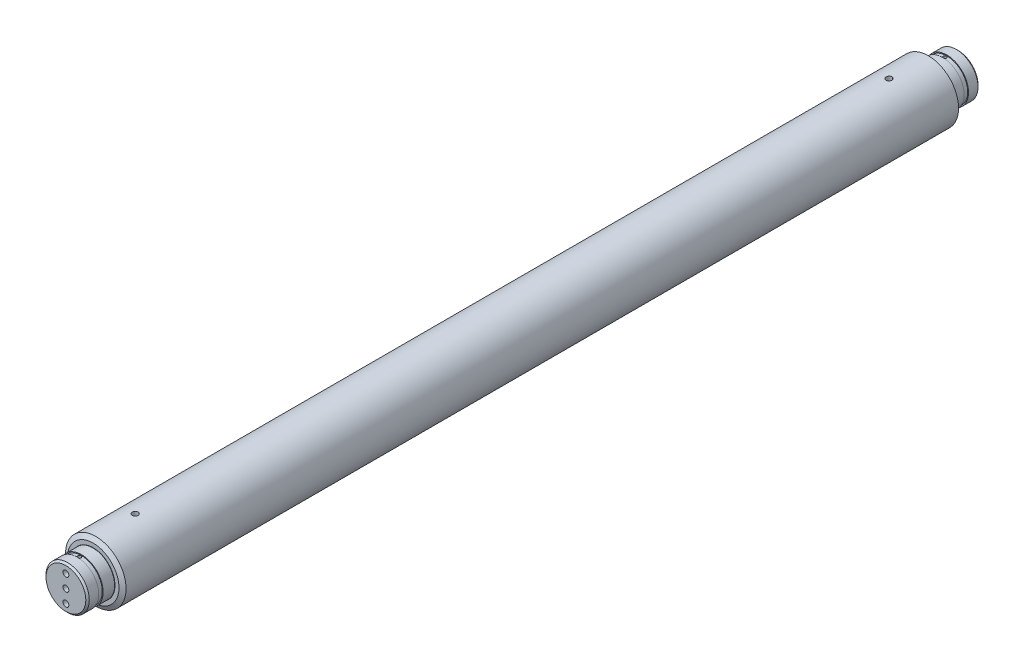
ISO-10303-21;
HEADER;
FILE_DESCRIPTION(('STEP AP214'),'2;1');
FILE_NAME('part.step','',(''),(''),'','','');
FILE_SCHEMA(('AUTOMOTIVE_DESIGN { 1 0 10303 214 1 1 1 1 }'));
ENDSEC;
DATA;
#1=APPLICATION_CONTEXT('core data for automotive mechanical design processes');
#2=APPLICATION_PROTOCOL_DEFINITION('international standard','automotive_design',2000,#1);
#3=PRODUCT_CONTEXT('',#1,'mechanical');
#4=PRODUCT('Part','Part','',(#3));
#5=PRODUCT_RELATED_PRODUCT_CATEGORY('part','',(#4));
#6=PRODUCT_DEFINITION_FORMATION('','',#4);
#7=PRODUCT_DEFINITION_CONTEXT('part definition',#1,'design');
#8=PRODUCT_DEFINITION('design','',#6,#7);
#9=PRODUCT_DEFINITION_SHAPE('','',#8);
#10=(LENGTH_UNIT() NAMED_UNIT(*) SI_UNIT(.MILLI.,.METRE.));
#11=(NAMED_UNIT(*) PLANE_ANGLE_UNIT() SI_UNIT($,.RADIAN.));
#12=(NAMED_UNIT(*) SI_UNIT($,.STERADIAN.) SOLID_ANGLE_UNIT());
#13=UNCERTAINTY_MEASURE_WITH_UNIT(LENGTH_MEASURE(1.E-05),#10,'distance_accuracy_value','');
#14=(GEOMETRIC_REPRESENTATION_CONTEXT(3) GLOBAL_UNCERTAINTY_ASSIGNED_CONTEXT((#13)) GLOBAL_UNIT_ASSIGNED_CONTEXT((#10,
#11,#12)) REPRESENTATION_CONTEXT('',''));
#15=CARTESIAN_POINT('',(0.,0.,0.));
#16=DIRECTION('',(0.,0.,1.));
#17=DIRECTION('',(1.,0.,0.));
#18=AXIS2_PLACEMENT_3D('',#15,#16,#17);
#19=CARTESIAN_POINT('',(0.,35.,-500.));
#20=DIRECTION('',(0.,1.,0.));
#21=DIRECTION('',(0.,0.,1.));
#22=AXIS2_PLACEMENT_3D('',#19,#20,#21);
#23=CYLINDRICAL_SURFACE('',#22,1.99999999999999);
#24=CARTESIAN_POINT('',(8.88178419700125E-13,11.5999999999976,-498.));
#25=CARTESIAN_POINT('',(0.102624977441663,11.6000043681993,-498.000004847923));
#26=CARTESIAN_POINT('',(0.205435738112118,11.6046981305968,-498.007955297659));
#27=CARTESIAN_POINT('',(0.407989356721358,11.6230267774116,-498.039360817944));
#28=CARTESIAN_POINT('',(0.507723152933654,11.6366858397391,-498.062857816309));
#29=CARTESIAN_POINT('',(0.700745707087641,11.6715577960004,-498.12405901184));
#30=CARTESIAN_POINT('',(0.794063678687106,11.6927333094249,-498.161692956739));
#31=CARTESIAN_POINT('',(0.972779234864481,11.7408166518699,-498.249676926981));
#32=CARTESIAN_POINT('',(1.05817929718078,11.7677226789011,-498.300022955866));
#33=CARTESIAN_POINT('',(1.22586972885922,11.8273447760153,-498.41620261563));
#34=CARTESIAN_POINT('',(1.30744987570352,11.8603448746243,-498.482912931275));
#35=CARTESIAN_POINT('',(1.45895767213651,11.92781245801,-498.627971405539));
#36=CARTESIAN_POINT('',(1.52887050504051,11.9622817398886,-498.706334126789));
#37=CARTESIAN_POINT('',(1.66332636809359,12.0335574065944,-498.883265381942));
#38=CARTESIAN_POINT('',(1.72628901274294,12.0701666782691,-498.983124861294));
#39=CARTESIAN_POINT('',(1.8342856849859,12.136534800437,-499.194155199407));
#40=CARTESIAN_POINT('',(1.8793481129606,12.1663044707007,-499.305307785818));
#41=CARTESIAN_POINT('',(1.94107416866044,12.2083539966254,-499.509296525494));
#42=CARTESIAN_POINT('',(1.96190925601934,12.2230932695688,-499.60036181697));
#43=CARTESIAN_POINT('',(1.99065727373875,12.2436239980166,-499.785457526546));
#44=CARTESIAN_POINT('',(1.99858531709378,12.249425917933,-499.879484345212));
#45=CARTESIAN_POINT('',(2.00106954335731,12.2512322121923,-500.067970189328));
#46=CARTESIAN_POINT('',(1.99560302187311,12.2472199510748,-500.162429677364));
#47=CARTESIAN_POINT('',(1.97158941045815,12.2299742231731,-500.348827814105));
#48=CARTESIAN_POINT('',(1.95303282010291,12.2167340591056,-500.440764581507));
#49=CARTESIAN_POINT('',(1.90401884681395,12.1829844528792,-500.619024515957));
#50=CARTESIAN_POINT('',(1.87366899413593,12.1625408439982,-500.705390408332));
#51=CARTESIAN_POINT('',(1.80215508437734,12.1165923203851,-500.872049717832));
#52=CARTESIAN_POINT('',(1.76098698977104,12.0910855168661,-500.952340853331));
#53=CARTESIAN_POINT('',(1.66098215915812,12.03267367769,-501.118976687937));
#54=CARTESIAN_POINT('',(1.60033557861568,11.9992467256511,-501.204053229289));
#55=CARTESIAN_POINT('',(1.46670878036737,11.9317139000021,-501.36367707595));
#56=CARTESIAN_POINT('',(1.39371727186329,11.8976074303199,-501.438214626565));
#57=CARTESIAN_POINT('',(1.2262939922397,11.8273899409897,-501.584320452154));
#58=CARTESIAN_POINT('',(1.13031267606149,11.7915838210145,-501.654278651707));
#59=CARTESIAN_POINT('',(0.925766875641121,11.7267083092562,-501.776834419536));
#60=CARTESIAN_POINT('',(0.817209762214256,11.6976350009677,-501.829442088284));
#61=CARTESIAN_POINT('',(0.597859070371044,11.6512267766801,-501.911900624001));
#62=CARTESIAN_POINT('',(0.487686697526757,11.6332434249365,-501.943024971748));
#63=CARTESIAN_POINT('',(0.2624745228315,11.6082613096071,-501.986002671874));
#64=CARTESIAN_POINT('',(0.147440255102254,11.6012503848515,-501.997877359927));
#65=CARTESIAN_POINT('',(-0.068032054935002,11.5991975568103,-502.001361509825));
#66=CARTESIAN_POINT('',(-0.168426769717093,11.6027203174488,-501.995401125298));
#67=CARTESIAN_POINT('',(-0.366524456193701,11.6183544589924,-501.968665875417));
#68=CARTESIAN_POINT('',(-0.46422743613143,11.6304658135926,-501.947891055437));
#69=CARTESIAN_POINT('',(-0.652577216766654,11.6618706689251,-501.893039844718));
#70=CARTESIAN_POINT('',(-0.743319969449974,11.6810296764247,-501.859211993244));
#71=CARTESIAN_POINT('',(-0.917856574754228,11.7249963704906,-501.779536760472));
#72=CARTESIAN_POINT('',(-1.00164893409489,11.7498052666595,-501.733686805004));
#73=CARTESIAN_POINT('',(-1.16933565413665,11.8060576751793,-501.625914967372));
#74=CARTESIAN_POINT('',(-1.25233009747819,11.8379232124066,-501.562815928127));
#75=CARTESIAN_POINT('',(-1.40719177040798,11.9037268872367,-501.424983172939));
#76=CARTESIAN_POINT('',(-1.47904583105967,11.9376674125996,-501.350235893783));
#77=CARTESIAN_POINT('',(-1.61862869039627,12.0088631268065,-501.180490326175));
#78=CARTESIAN_POINT('',(-1.68476854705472,12.0460138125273,-501.084132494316));
#79=CARTESIAN_POINT('',(-1.79987765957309,12.1147019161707,-500.879853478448));
#80=CARTESIAN_POINT('',(-1.84886727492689,12.1462459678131,-500.77194620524));
#81=CARTESIAN_POINT('',(-1.91898299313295,12.1930646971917,-500.571172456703));
#82=CARTESIAN_POINT('',(-1.94384155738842,12.2103816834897,-500.480089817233));
#83=CARTESIAN_POINT('',(-1.9805080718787,12.2362877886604,-500.294171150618));
#84=CARTESIAN_POINT('',(-1.99233281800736,12.2448881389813,-500.199340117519));
#85=CARTESIAN_POINT('',(-2.00227522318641,12.252102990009,-500.00828131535));
#86=CARTESIAN_POINT('',(-2.00035201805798,12.2506877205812,-499.912050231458));
#87=CARTESIAN_POINT('',(-1.98282528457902,12.2380239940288,-499.721482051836));
#88=CARTESIAN_POINT('',(-1.96721361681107,12.2267696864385,-499.627146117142));
#89=CARTESIAN_POINT('',(-1.92396602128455,12.1966074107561,-499.446176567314));
#90=CARTESIAN_POINT('',(-1.8967657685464,12.1779783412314,-499.359389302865));
#91=CARTESIAN_POINT('',(-1.83150638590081,12.1351959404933,-499.191477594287));
#92=CARTESIAN_POINT('',(-1.79344317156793,12.1110405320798,-499.110355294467));
#93=CARTESIAN_POINT('',(-1.70075199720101,12.0553792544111,-498.942649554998));
#94=CARTESIAN_POINT('',(-1.64447161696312,12.0233143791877,-498.857165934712));
#95=CARTESIAN_POINT('',(-1.51987516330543,11.9578062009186,-498.696017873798));
#96=CARTESIAN_POINT('',(-1.45154946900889,11.9243618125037,-498.620361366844));
#97=CARTESIAN_POINT('',(-1.29293437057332,11.8540672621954,-498.469650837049));
#98=CARTESIAN_POINT('',(-1.20089294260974,11.8174384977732,-498.396317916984));
#99=CARTESIAN_POINT('',(-1.00383701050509,11.7498975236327,-498.266143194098));
#100=CARTESIAN_POINT('',(-0.898819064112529,11.7189868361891,-498.20930578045));
#101=CARTESIAN_POINT('',(-0.682920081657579,11.6675322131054,-498.116713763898));
#102=CARTESIAN_POINT('',(-0.572483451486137,11.6466006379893,-498.080159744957));
#103=CARTESIAN_POINT('',(-0.402565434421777,11.6234289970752,-498.040066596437));
#104=CARTESIAN_POINT('',(-0.345280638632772,11.6170785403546,-498.029162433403));
#105=CARTESIAN_POINT('',(-0.229749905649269,11.6072783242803,-498.012385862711));
#106=CARTESIAN_POINT('',(-0.1715048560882,11.6038260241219,-498.006509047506));
#107=CARTESIAN_POINT('',(-0.0942699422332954,11.6012547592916,-498.002133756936));
#108=CARTESIAN_POINT('',(-0.075428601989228,11.6007846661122,-498.001334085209));
#109=CARTESIAN_POINT('',(-0.0377269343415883,11.6001568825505,-498.000266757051));
#110=CARTESIAN_POINT('',(-0.0188666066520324,11.5999991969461,-497.999999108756));
#111=CARTESIAN_POINT('',(8.88178419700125E-13,11.5999999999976,-498.));
#112=B_SPLINE_CURVE_WITH_KNOTS('',3,(#24,#25,#26,#27,#28,#29,#30,#31,#32,#33,#34,#35,#36,#37,
#38,#39,#40,#41,#42,#43,#44,#45,#46,#47,#48,#49,#50,#51,#52,#53,#54,#55,#56,#57,#58,#59,#60,#61,
#62,#63,#64,#65,#66,#67,#68,#69,#70,#71,#72,#73,#74,#75,#76,#77,#78,#79,#80,#81,#82,#83,#84,#85,
#86,#87,#88,#89,#90,#91,#92,#93,#94,#95,#96,#97,#98,#99,#100,#101,#102,#103,#104,#105,#106,#107,
#108,#109,#110,#111),.UNSPECIFIED.,.T.,.F.,(4,2,2,2,2,2,2,2,2,2,2,2,2,2,2,2,2,2,2,2,2,2,2,2,2,2,
2,2,2,2,2,2,2,2,2,2,2,2,2,2,2,2,2,4),(0.,0.307797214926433,0.616427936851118,0.92354481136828,
1.23056525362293,1.56054697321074,1.89094460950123,2.25992393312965,2.62831547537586,
2.91082528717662,3.19300406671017,3.47566148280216,3.75852425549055,4.0388662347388,
4.31931299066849,4.64712883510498,4.97524614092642,5.3454930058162,5.71552395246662,
6.06111668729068,6.4063261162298,6.70673153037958,7.0071360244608,7.30208236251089,
7.59709190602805,7.92285433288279,8.24899895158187,8.61517633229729,8.98091752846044,
9.26768033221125,9.55407316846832,9.84131762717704,10.1287330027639,10.4061830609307,
10.6837375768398,11.0042754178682,11.32507044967,11.6929897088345,12.0610067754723,
12.4132457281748,12.5889807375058,12.7645615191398,12.8211461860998,12.8777317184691),.UNSPECIFIED.);
#113=CARTESIAN_POINT('',(8.88178419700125E-13,11.5999999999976,-498.));
#114=VERTEX_POINT('',#113);
#115=EDGE_CURVE('E99',#114,#114,#112,.T.);
#116=ORIENTED_EDGE('',*,*,#115,.T.);
#117=EDGE_LOOP('',(#116));
#118=FACE_BOUND('',#117,.T.);
#119=CARTESIAN_POINT('',(8.88178419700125E-13,3.39999999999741,-498.));
#120=CARTESIAN_POINT('',(-0.102624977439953,3.39999563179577,-498.000004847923));
#121=CARTESIAN_POINT('',(-0.205435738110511,3.39530186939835,-498.007955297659));
#122=CARTESIAN_POINT('',(-0.407989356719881,3.37697322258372,-498.039360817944));
#123=CARTESIAN_POINT('',(-0.507723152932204,3.36331416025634,-498.062857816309));
#124=CARTESIAN_POINT('',(-0.700745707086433,3.32844220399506,-498.12405901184));
#125=CARTESIAN_POINT('',(-0.794063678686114,3.30726669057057,-498.161692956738));
#126=CARTESIAN_POINT('',(-0.972779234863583,3.25918334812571,-498.249676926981));
#127=CARTESIAN_POINT('',(-1.05817929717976,3.23227732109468,-498.300022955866));
#128=CARTESIAN_POINT('',(-1.22586972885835,3.17265522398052,-498.41620261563));
#129=CARTESIAN_POINT('',(-1.30744987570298,3.13965512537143,-498.482912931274));
#130=CARTESIAN_POINT('',(-1.45895767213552,3.07218754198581,-498.627971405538));
#131=CARTESIAN_POINT('',(-1.52887050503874,3.0377182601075,-498.706334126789));
#132=CARTESIAN_POINT('',(-1.66332636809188,2.96644259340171,-498.883265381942));
#133=CARTESIAN_POINT('',(-1.72628901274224,2.92983332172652,-498.983124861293));
#134=CARTESIAN_POINT('',(-1.83428568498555,2.86346519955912,-499.194155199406));
#135=CARTESIAN_POINT('',(-1.87934811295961,2.83369552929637,-499.305307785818));
#136=CARTESIAN_POINT('',(-1.94107416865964,2.79164600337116,-499.509296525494));
#137=CARTESIAN_POINT('',(-1.96190925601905,2.77690673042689,-499.600361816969));
#138=CARTESIAN_POINT('',(-1.99065727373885,2.75637600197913,-499.785457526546));
#139=CARTESIAN_POINT('',(-1.99858531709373,2.75057408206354,-499.879484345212));
#140=CARTESIAN_POINT('',(-2.00106954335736,2.74876778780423,-500.067970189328));
#141=CARTESIAN_POINT('',(-1.99560302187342,2.7527800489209,-500.162429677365));
#142=CARTESIAN_POINT('',(-1.97158941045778,2.7700257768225,-500.348827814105));
#143=CARTESIAN_POINT('',(-1.9530328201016,2.78326594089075,-500.440764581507));
#144=CARTESIAN_POINT('',(-1.90401884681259,2.81701554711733,-500.619024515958));
#145=CARTESIAN_POINT('',(-1.87366899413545,2.8374591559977,-500.705390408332));
#146=CARTESIAN_POINT('',(-1.80215508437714,2.88340767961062,-500.872049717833));
#147=CARTESIAN_POINT('',(-1.76098698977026,2.90891448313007,-500.952340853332));
#148=CARTESIAN_POINT('',(-1.66098215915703,2.96732632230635,-501.118976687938));
#149=CARTESIAN_POINT('',(-1.60033557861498,3.00075327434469,-501.20405322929));
#150=CARTESIAN_POINT('',(-1.46670878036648,3.06828609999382,-501.363677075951));
#151=CARTESIAN_POINT('',(-1.3937172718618,3.10239256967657,-501.438214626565));
#152=CARTESIAN_POINT('',(-1.22629399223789,3.17261005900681,-501.584320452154));
#153=CARTESIAN_POINT('',(-1.13031267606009,3.20841617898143,-501.654278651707));
#154=CARTESIAN_POINT('',(-0.925766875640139,3.27329169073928,-501.776834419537));
#155=CARTESIAN_POINT('',(-0.817209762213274,3.30236499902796,-501.829442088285));
#156=CARTESIAN_POINT('',(-0.597859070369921,3.34877322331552,-501.911900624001));
#157=CARTESIAN_POINT('',(-0.487686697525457,3.36675657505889,-501.943024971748));
#158=CARTESIAN_POINT('',(-0.262474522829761,3.3917386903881,-501.986002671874));
#159=CARTESIAN_POINT('',(-0.147440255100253,3.39874961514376,-501.997877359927));
#160=CARTESIAN_POINT('',(0.068032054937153,3.40080244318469,-502.001361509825));
#161=CARTESIAN_POINT('',(0.168426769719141,3.39727968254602,-501.995401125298));
#162=CARTESIAN_POINT('',(0.366524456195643,3.38164554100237,-501.968665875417));
#163=CARTESIAN_POINT('',(0.464227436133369,3.36953418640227,-501.947891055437));
#164=CARTESIAN_POINT('',(0.652577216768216,3.33812933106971,-501.893039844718));
#165=CARTESIAN_POINT('',(0.743319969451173,3.31897032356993,-501.859211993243));
#166=CARTESIAN_POINT('',(0.917856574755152,3.27500362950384,-501.779536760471));
#167=CARTESIAN_POINT('',(1.0016489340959,3.2501947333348,-501.733686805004));
#168=CARTESIAN_POINT('',(1.16933565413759,3.19394232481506,-501.625914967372));
#169=CARTESIAN_POINT('',(1.25233009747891,3.16207678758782,-501.562815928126));
#170=CARTESIAN_POINT('',(1.4071917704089,3.09627311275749,-501.424983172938));
#171=CARTESIAN_POINT('',(1.47904583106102,3.06233258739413,-501.350235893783));
#172=CARTESIAN_POINT('',(1.61862869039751,2.9911368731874,-501.180490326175));
#173=CARTESIAN_POINT('',(1.68476854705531,2.9539861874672,-501.084132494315));
#174=CARTESIAN_POINT('',(1.79987765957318,2.88529808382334,-500.879853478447));
#175=CARTESIAN_POINT('',(1.84886727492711,2.85375403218,-500.771946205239));
#176=CARTESIAN_POINT('',(1.91898299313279,2.80693530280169,-500.571172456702));
#177=CARTESIAN_POINT('',(1.9438415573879,2.78961831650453,-500.480089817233));
#178=CARTESIAN_POINT('',(1.98050807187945,2.76371221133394,-500.294171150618));
#179=CARTESIAN_POINT('',(1.99233281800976,2.75511186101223,-500.199340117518));
#180=CARTESIAN_POINT('',(2.00227522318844,2.7478970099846,-500.00828131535));
#181=CARTESIAN_POINT('',(2.00035201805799,2.74931227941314,-499.912050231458));
#182=CARTESIAN_POINT('',(1.98282528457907,2.76197600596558,-499.721482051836));
#183=CARTESIAN_POINT('',(1.96721361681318,2.77323031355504,-499.627146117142));
#184=CARTESIAN_POINT('',(1.92396602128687,2.80339258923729,-499.446176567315));
#185=CARTESIAN_POINT('',(1.89676576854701,2.82202165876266,-499.359389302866));
#186=CARTESIAN_POINT('',(1.831506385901,2.86480405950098,-499.191477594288));
#187=CARTESIAN_POINT('',(1.79344317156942,2.88895946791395,-499.110355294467));
#188=CARTESIAN_POINT('',(1.70075199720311,2.94462074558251,-498.942649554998));
#189=CARTESIAN_POINT('',(1.64447161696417,2.97668562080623,-498.857165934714));
#190=CARTESIAN_POINT('',(1.5198751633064,3.04219379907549,-498.696017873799));
#191=CARTESIAN_POINT('',(1.45154946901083,3.07563818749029,-498.620361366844));
#192=CARTESIAN_POINT('',(1.2929343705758,3.14593273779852,-498.469650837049));
#193=CARTESIAN_POINT('',(1.20089294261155,3.18256150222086,-498.396317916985));
#194=CARTESIAN_POINT('',(1.00383701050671,3.25010247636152,-498.266143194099));
#195=CARTESIAN_POINT('',(0.898819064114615,3.28101316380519,-498.20930578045));
#196=CARTESIAN_POINT('',(0.682920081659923,3.33246778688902,-498.116713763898));
#197=CARTESIAN_POINT('',(0.572483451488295,3.35339936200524,-498.080159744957));
#198=CARTESIAN_POINT('',(0.402565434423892,3.37657100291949,-498.040066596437));
#199=CARTESIAN_POINT('',(0.345280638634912,3.38292145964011,-498.029162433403));
#200=CARTESIAN_POINT('',(0.229749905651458,3.39272167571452,-498.012385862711));
#201=CARTESIAN_POINT('',(0.171504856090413,3.39617397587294,-498.006509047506));
#202=CARTESIAN_POINT('',(0.0942699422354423,3.39874524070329,-498.002133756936));
#203=CARTESIAN_POINT('',(0.0754286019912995,3.3992153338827,-498.001334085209));
#204=CARTESIAN_POINT('',(0.0377269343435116,3.39984311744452,-498.000266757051));
#205=CARTESIAN_POINT('',(0.0188666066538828,3.4000008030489,-497.999999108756));
#206=CARTESIAN_POINT('',(8.88178419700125E-13,3.39999999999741,-498.));
#207=B_SPLINE_CURVE_WITH_KNOTS('',3,(#119,#120,#121,#122,#123,#124,#125,#126,#127,#128,#129,
#130,#131,#132,#133,#134,#135,#136,#137,#138,#139,#140,#141,#142,#143,#144,#145,#146,#147,#148,
#149,#150,#151,#152,#153,#154,#155,#156,#157,#158,#159,#160,#161,#162,#163,#164,#165,#166,#167,
#168,#169,#170,#171,#172,#173,#174,#175,#176,#177,#178,#179,#180,#181,#182,#183,#184,#185,#186,
#187,#188,#189,#190,#191,#192,#193,#194,#195,#196,#197,#198,#199,#200,#201,#202,#203,#204,#205,
#206),.UNSPECIFIED.,.T.,.F.,(4,2,2,2,2,2,2,2,2,2,2,2,2,2,2,2,2,2,2,2,2,2,2,2,2,2,2,2,2,2,2,2,2,
2,2,2,2,2,2,2,2,2,2,4),(0.,0.307797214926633,0.616427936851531,0.923544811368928,
1.2305652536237,1.56054697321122,1.89094460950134,2.25992393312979,2.6283154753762,
2.91082528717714,3.19300406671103,3.47566148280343,3.75852425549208,4.03886623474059,
4.31931299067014,4.64712883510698,4.97524614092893,5.34549300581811,5.71552395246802,
6.06111668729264,6.40632611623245,6.70673153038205,7.007136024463,7.30208236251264,
7.59709190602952,7.92285433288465,8.24899895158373,8.61517633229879,8.98091752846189,
9.26768033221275,9.55407316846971,9.84131762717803,10.1287330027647,10.4061830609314,
10.6837375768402,11.0042754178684,11.32507044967,11.6929897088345,12.0610067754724,
12.413245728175,12.5889807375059,12.7645615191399,12.8211461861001,12.8777317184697),.UNSPECIFIED.);
#208=CARTESIAN_POINT('',(8.88178419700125E-13,3.39999999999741,-498.));
#209=VERTEX_POINT('',#208);
#210=EDGE_CURVE('E116',#209,#209,#207,.T.);
#211=ORIENTED_EDGE('',*,*,#210,.T.);
#212=EDGE_LOOP('',(#211));
#213=FACE_BOUND('',#212,.T.);
#214=ADVANCED_FACE('F34',(#118,#213),#23,.F.);
#215=CARTESIAN_POINT('',(0.,35.,500.));
#216=DIRECTION('',(0.,1.,0.));
#217=DIRECTION('',(0.,0.,1.));
#218=AXIS2_PLACEMENT_3D('',#215,#216,#217);
#219=CYLINDRICAL_SURFACE('',#218,1.99999999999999);
#220=CARTESIAN_POINT('',(8.88178419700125E-13,11.5999999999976,502.));
#221=CARTESIAN_POINT('',(0.102624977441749,11.6000043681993,501.999995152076));
#222=CARTESIAN_POINT('',(0.20543573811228,11.6046981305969,501.992044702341));
#223=CARTESIAN_POINT('',(0.40798935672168,11.6230267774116,501.960639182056));
#224=CARTESIAN_POINT('',(0.507723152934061,11.6366858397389,501.937142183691));
#225=CARTESIAN_POINT('',(0.700745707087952,11.6715577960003,501.87594098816));
#226=CARTESIAN_POINT('',(0.794063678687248,11.6927333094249,501.838307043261));
#227=CARTESIAN_POINT('',(0.972779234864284,11.74081665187,501.750323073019));
#228=CARTESIAN_POINT('',(1.05817929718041,11.7677226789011,501.699977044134));
#229=CARTESIAN_POINT('',(1.22586972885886,11.8273447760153,501.58379738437));
#230=CARTESIAN_POINT('',(1.30744987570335,11.8603448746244,501.517087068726));
#231=CARTESIAN_POINT('',(1.45895767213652,11.9278124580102,501.372028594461));
#232=CARTESIAN_POINT('',(1.52887050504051,11.9622817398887,501.293665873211));
#233=CARTESIAN_POINT('',(1.66332636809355,12.0335574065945,501.116734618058));
#234=CARTESIAN_POINT('',(1.72628901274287,12.0701666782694,501.016875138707));
#235=CARTESIAN_POINT('',(1.83428568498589,12.1365348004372,500.805844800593));
#236=CARTESIAN_POINT('',(1.87934811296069,12.1663044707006,500.694692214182));
#237=CARTESIAN_POINT('',(1.94107416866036,12.2083539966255,500.490703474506));
#238=CARTESIAN_POINT('',(1.96190925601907,12.2230932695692,500.399638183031));
#239=CARTESIAN_POINT('',(1.99065727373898,12.2436239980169,500.214542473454));
#240=CARTESIAN_POINT('',(1.99858531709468,12.249425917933,500.120515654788));
#241=CARTESIAN_POINT('',(2.00106954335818,12.2512322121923,499.932029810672));
#242=CARTESIAN_POINT('',(1.99560302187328,12.2472199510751,499.837570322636));
#243=CARTESIAN_POINT('',(1.97158941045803,12.2299742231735,499.651172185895));
#244=CARTESIAN_POINT('',(1.95303282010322,12.2167340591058,499.559235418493));
#245=CARTESIAN_POINT('',(1.90401884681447,12.1829844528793,499.380975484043));
#246=CARTESIAN_POINT('',(1.8736689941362,12.1625408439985,499.294609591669));
#247=CARTESIAN_POINT('',(1.80215508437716,12.1165923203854,499.127950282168));
#248=CARTESIAN_POINT('',(1.76098698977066,12.0910855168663,499.047659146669));
#249=CARTESIAN_POINT('',(1.66098215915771,12.0326736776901,498.881023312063));
#250=CARTESIAN_POINT('',(1.60033557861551,11.9992467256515,498.795946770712));
#251=CARTESIAN_POINT('',(1.46670878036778,11.9317139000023,498.636322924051));
#252=CARTESIAN_POINT('',(1.39371727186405,11.8976074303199,498.561785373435));
#253=CARTESIAN_POINT('',(1.22629399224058,11.8273899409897,498.415679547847));
#254=CARTESIAN_POINT('',(1.13031267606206,11.7915838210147,498.345721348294));
#255=CARTESIAN_POINT('',(0.925766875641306,11.7267083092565,498.223165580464));
#256=CARTESIAN_POINT('',(0.817209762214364,11.6976350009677,498.170557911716));
#257=CARTESIAN_POINT('',(0.597859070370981,11.65122677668,498.088099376));
#258=CARTESIAN_POINT('',(0.487686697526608,11.6332434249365,498.056975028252));
#259=CARTESIAN_POINT('',(0.262474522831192,11.6082613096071,498.013997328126));
#260=CARTESIAN_POINT('',(0.147440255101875,11.6012503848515,498.002122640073));
#261=CARTESIAN_POINT('',(-0.0680320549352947,11.5991975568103,497.998638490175));
#262=CARTESIAN_POINT('',(-0.16842676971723,11.6027203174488,498.004598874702));
#263=CARTESIAN_POINT('',(-0.366524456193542,11.6183544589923,498.031334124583));
#264=CARTESIAN_POINT('',(-0.46422743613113,11.6304658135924,498.052108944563));
#265=CARTESIAN_POINT('',(-0.652577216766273,11.6618706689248,498.106960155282));
#266=CARTESIAN_POINT('',(-0.743319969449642,11.6810296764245,498.140788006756));
#267=CARTESIAN_POINT('',(-0.917856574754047,11.7249963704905,498.220463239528));
#268=CARTESIAN_POINT('',(-1.00164893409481,11.7498052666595,498.266313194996));
#269=CARTESIAN_POINT('',(-1.16933565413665,11.8060576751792,498.374085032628));
#270=CARTESIAN_POINT('',(-1.25233009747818,11.8379232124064,498.437184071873));
#271=CARTESIAN_POINT('',(-1.40719177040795,11.9037268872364,498.575016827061));
#272=CARTESIAN_POINT('',(-1.47904583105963,11.9376674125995,498.649764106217));
#273=CARTESIAN_POINT('',(-1.61862869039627,12.0088631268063,498.819509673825));
#274=CARTESIAN_POINT('',(-1.68476854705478,12.0460138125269,498.915867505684));
#275=CARTESIAN_POINT('',(-1.79987765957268,12.1147019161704,499.120146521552));
#276=CARTESIAN_POINT('',(-1.84886727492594,12.1462459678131,499.22805379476));
#277=CARTESIAN_POINT('',(-1.91898299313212,12.1930646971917,499.428827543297));
#278=CARTESIAN_POINT('',(-1.94384155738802,12.2103816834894,499.519910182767));
#279=CARTESIAN_POINT('',(-1.98050807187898,12.23628778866,499.705828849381));
#280=CARTESIAN_POINT('',(-1.99233281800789,12.2448881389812,499.800659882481));
#281=CARTESIAN_POINT('',(-2.00227522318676,12.2521029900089,499.99171868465));
#282=CARTESIAN_POINT('',(-2.00035201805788,12.2506877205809,500.087949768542));
#283=CARTESIAN_POINT('',(-1.98282528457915,12.2380239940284,500.278517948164));
#284=CARTESIAN_POINT('',(-1.9672136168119,12.2267696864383,500.372853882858));
#285=CARTESIAN_POINT('',(-1.92396602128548,12.1966074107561,500.553823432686));
#286=CARTESIAN_POINT('',(-1.89676576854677,12.1779783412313,500.640610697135));
#287=CARTESIAN_POINT('',(-1.8315063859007,12.135195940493,500.808522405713));
#288=CARTESIAN_POINT('',(-1.79344317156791,12.1110405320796,500.889644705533));
#289=CARTESIAN_POINT('',(-1.70075199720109,12.0553792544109,501.057350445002));
#290=CARTESIAN_POINT('',(-1.64447161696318,12.0233143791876,501.142834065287));
#291=CARTESIAN_POINT('',(-1.51987516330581,11.9578062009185,501.303982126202));
#292=CARTESIAN_POINT('',(-1.45154946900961,11.9243618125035,501.379638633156));
#293=CARTESIAN_POINT('',(-1.2929343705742,11.8540672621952,501.530349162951));
#294=CARTESIAN_POINT('',(-1.20089294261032,11.8174384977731,501.603682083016));
#295=CARTESIAN_POINT('',(-1.00383701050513,11.7498975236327,501.733856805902));
#296=CARTESIAN_POINT('',(-0.898819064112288,11.7189868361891,501.79069421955));
#297=CARTESIAN_POINT('',(-0.682920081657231,11.6675322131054,501.883286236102));
#298=CARTESIAN_POINT('',(-0.572483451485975,11.6466006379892,501.919840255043));
#299=CARTESIAN_POINT('',(-0.402565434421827,11.6234289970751,501.959933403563));
#300=CARTESIAN_POINT('',(-0.345280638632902,11.6170785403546,501.970837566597));
#301=CARTESIAN_POINT('',(-0.229749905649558,11.6072783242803,501.987614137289));
#302=CARTESIAN_POINT('',(-0.171504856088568,11.6038260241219,501.993490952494));
#303=CARTESIAN_POINT('',(-0.0942699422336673,11.6012547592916,501.997866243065));
#304=CARTESIAN_POINT('',(-0.0754286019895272,11.6007846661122,501.998665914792));
#305=CARTESIAN_POINT('',(-0.0377269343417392,11.6001568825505,501.99973324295));
#306=CARTESIAN_POINT('',(-0.0188666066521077,11.5999991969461,502.000000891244));
#307=CARTESIAN_POINT('',(8.88178419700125E-13,11.5999999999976,502.));
#308=B_SPLINE_CURVE_WITH_KNOTS('',3,(#220,#221,#222,#223,#224,#225,#226,#227,#228,#229,#230,
#231,#232,#233,#234,#235,#236,#237,#238,#239,#240,#241,#242,#243,#244,#245,#246,#247,#248,#249,
#250,#251,#252,#253,#254,#255,#256,#257,#258,#259,#260,#261,#262,#263,#264,#265,#266,#267,#268,
#269,#270,#271,#272,#273,#274,#275,#276,#277,#278,#279,#280,#281,#282,#283,#284,#285,#286,#287,
#288,#289,#290,#291,#292,#293,#294,#295,#296,#297,#298,#299,#300,#301,#302,#303,#304,#305,#306,
#307),.UNSPECIFIED.,.T.,.F.,(4,2,2,2,2,2,2,2,2,2,2,2,2,2,2,2,2,2,2,2,2,2,2,2,2,2,2,2,2,2,2,2,2,
2,2,2,2,2,2,2,2,2,2,4),(0.,0.307797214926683,0.616427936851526,0.923544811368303,
1.23056525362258,1.56054697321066,1.89094460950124,2.25992393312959,2.62831547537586,
2.91082528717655,3.19300406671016,3.47566148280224,3.75852425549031,4.03886623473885,
4.3193129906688,4.64712883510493,4.97524614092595,5.34549300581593,5.71552395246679,
6.06111668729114,6.40632611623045,6.70673153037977,7.00713602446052,7.3020823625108,
7.59709190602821,7.92285433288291,8.24899895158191,8.61517633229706,8.98091752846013,
9.26768033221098,9.55407316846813,9.84131762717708,10.1287330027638,10.4061830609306,
10.6837375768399,11.0042754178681,11.3250704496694,11.6929897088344,12.0610067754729,
12.4132457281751,12.5889807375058,12.7645615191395,12.8211461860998,12.8777317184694),.UNSPECIFIED.);
#309=CARTESIAN_POINT('',(8.88178419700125E-13,11.5999999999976,502.));
#310=VERTEX_POINT('',#309);
#311=EDGE_CURVE('E113',#310,#310,#308,.T.);
#312=ORIENTED_EDGE('',*,*,#311,.T.);
#313=EDGE_LOOP('',(#312));
#314=FACE_BOUND('',#313,.T.);
#315=CARTESIAN_POINT('',(8.88178419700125E-13,3.39999999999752,502.));
#316=CARTESIAN_POINT('',(0.102624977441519,3.39999563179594,501.999995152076));
#317=CARTESIAN_POINT('',(0.205435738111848,3.39530186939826,501.992044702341));
#318=CARTESIAN_POINT('',(0.407989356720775,3.37697322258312,501.960639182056));
#319=CARTESIAN_POINT('',(0.507723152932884,3.36331416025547,501.937142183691));
#320=CARTESIAN_POINT('',(0.700745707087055,3.32844220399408,501.87594098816));
#321=CARTESIAN_POINT('',(0.794063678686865,3.30726669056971,501.838307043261));
#322=CARTESIAN_POINT('',(0.972779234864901,3.25918334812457,501.750323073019));
#323=CARTESIAN_POINT('',(1.05817929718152,3.23227732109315,501.699977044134));
#324=CARTESIAN_POINT('',(1.22586972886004,3.17265522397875,501.58379738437));
#325=CARTESIAN_POINT('',(1.3074498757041,3.13965512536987,501.517087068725));
#326=CARTESIAN_POINT('',(1.45895767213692,3.07218754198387,501.372028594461));
#327=CARTESIAN_POINT('',(1.52887050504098,3.03771826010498,501.29366587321));
#328=CARTESIAN_POINT('',(1.66332636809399,2.96644259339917,501.116734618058));
#329=CARTESIAN_POINT('',(1.72628901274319,2.9298333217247,501.016875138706));
#330=CARTESIAN_POINT('',(1.834285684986,2.86346519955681,500.805844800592));
#331=CARTESIAN_POINT('',(1.87934811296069,2.83369552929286,500.694692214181));
#332=CARTESIAN_POINT('',(1.94107416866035,2.79164600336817,500.490703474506));
#333=CARTESIAN_POINT('',(1.96190925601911,2.77690673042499,500.39963818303));
#334=CARTESIAN_POINT('',(1.99065727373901,2.75637600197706,500.214542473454));
#335=CARTESIAN_POINT('',(1.99858531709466,2.75057408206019,500.120515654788));
#336=CARTESIAN_POINT('',(2.00106954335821,2.74876778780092,499.932029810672));
#337=CARTESIAN_POINT('',(1.99560302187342,2.75278004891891,499.837570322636));
#338=CARTESIAN_POINT('',(1.97158941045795,2.77002577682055,499.651172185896));
#339=CARTESIAN_POINT('',(1.95303282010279,2.78326594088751,499.559235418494));
#340=CARTESIAN_POINT('',(1.90401884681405,2.81701554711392,499.380975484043));
#341=CARTESIAN_POINT('',(1.87366899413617,2.8374591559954,499.294609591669));
#342=CARTESIAN_POINT('',(1.80215508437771,2.88340767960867,499.127950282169));
#343=CARTESIAN_POINT('',(1.76098698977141,2.90891448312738,499.047659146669));
#344=CARTESIAN_POINT('',(1.66098215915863,2.96732632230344,498.881023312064));
#345=CARTESIAN_POINT('',(1.60033557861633,3.00075327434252,498.795946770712));
#346=CARTESIAN_POINT('',(1.46670878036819,3.06828609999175,498.636322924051));
#347=CARTESIAN_POINT('',(1.39371727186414,3.10239256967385,498.561785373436));
#348=CARTESIAN_POINT('',(1.2262939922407,3.17261005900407,498.415679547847));
#349=CARTESIAN_POINT('',(1.13031267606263,3.20841617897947,498.345721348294));
#350=CARTESIAN_POINT('',(0.925766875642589,3.27329169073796,498.223165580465));
#351=CARTESIAN_POINT('',(0.817209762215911,3.30236499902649,498.170557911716));
#352=CARTESIAN_POINT('',(0.597859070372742,3.34877322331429,498.088099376));
#353=CARTESIAN_POINT('',(0.487686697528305,3.36675657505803,498.056975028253));
#354=CARTESIAN_POINT('',(0.262474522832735,3.39173869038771,498.013997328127));
#355=CARTESIAN_POINT('',(0.147440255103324,3.39874961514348,498.002122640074));
#356=CARTESIAN_POINT('',(-0.0680320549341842,3.40080244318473,497.998638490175));
#357=CARTESIAN_POINT('',(-0.168426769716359,3.39727968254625,498.004598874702));
#358=CARTESIAN_POINT('',(-0.366524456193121,3.38164554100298,498.031334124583));
#359=CARTESIAN_POINT('',(-0.464227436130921,3.36953418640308,498.052108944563));
#360=CARTESIAN_POINT('',(-0.652577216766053,3.33812933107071,498.106960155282));
#361=CARTESIAN_POINT('',(-0.743319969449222,3.31897032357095,498.140788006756));
#362=CARTESIAN_POINT('',(-0.917856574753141,3.27500362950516,498.220463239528));
#363=CARTESIAN_POINT('',(-1.00164893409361,3.2501947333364,498.266313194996));
#364=CARTESIAN_POINT('',(-1.16933565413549,3.19394232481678,498.374085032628));
#365=CARTESIAN_POINT('',(-1.25233009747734,3.16207678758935,498.437184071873));
#366=CARTESIAN_POINT('',(-1.40719177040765,3.09627311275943,498.575016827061));
#367=CARTESIAN_POINT('',(-1.47904583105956,3.0623325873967,498.649764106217));
#368=CARTESIAN_POINT('',(-1.61862869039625,2.99113687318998,498.819509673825));
#369=CARTESIAN_POINT('',(-1.68476854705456,2.95398618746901,498.915867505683));
#370=CARTESIAN_POINT('',(-1.7998776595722,2.88529808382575,499.120146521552));
#371=CARTESIAN_POINT('',(-1.84886727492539,2.8537540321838,499.22805379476));
#372=CARTESIAN_POINT('',(-1.91898299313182,2.80693530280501,499.428827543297));
#373=CARTESIAN_POINT('',(-1.94384155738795,2.78961831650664,499.519910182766));
#374=CARTESIAN_POINT('',(-1.98050807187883,2.763712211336,499.705828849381));
#375=CARTESIAN_POINT('',(-1.99233281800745,2.75511186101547,499.800659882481));
#376=CARTESIAN_POINT('',(-2.00227522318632,2.7478970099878,499.99171868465));
#377=CARTESIAN_POINT('',(-2.00035201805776,2.74931227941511,500.087949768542));
#378=CARTESIAN_POINT('',(-1.98282528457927,2.76197600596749,500.278517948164));
#379=CARTESIAN_POINT('',(-1.96721361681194,2.7732303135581,500.372853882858));
#380=CARTESIAN_POINT('',(-1.92396602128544,2.80339258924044,500.553823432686));
#381=CARTESIAN_POINT('',(-1.89676576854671,2.82202165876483,500.640610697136));
#382=CARTESIAN_POINT('',(-1.83150638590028,2.86480405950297,500.808522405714));
#383=CARTESIAN_POINT('',(-1.79344317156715,2.88895946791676,500.889644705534));
#384=CARTESIAN_POINT('',(-1.70075199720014,2.94462074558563,501.057350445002));
#385=CARTESIAN_POINT('',(-1.64447161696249,2.9766856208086,501.142834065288));
#386=CARTESIAN_POINT('',(-1.51987516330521,3.04219379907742,501.303982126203));
#387=CARTESIAN_POINT('',(-1.45154946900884,3.07563818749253,501.379638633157));
#388=CARTESIAN_POINT('',(-1.29293437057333,3.14593273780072,501.530349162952));
#389=CARTESIAN_POINT('',(-1.20089294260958,3.18256150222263,501.603682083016));
#390=CARTESIAN_POINT('',(-1.00383701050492,3.25010247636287,501.733856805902));
#391=CARTESIAN_POINT('',(-0.898819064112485,3.28101316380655,501.79069421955));
#392=CARTESIAN_POINT('',(-0.682920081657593,3.33246778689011,501.883286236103));
#393=CARTESIAN_POINT('',(-0.572483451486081,3.35339936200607,501.919840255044));
#394=CARTESIAN_POINT('',(-0.402565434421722,3.37657100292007,501.959933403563));
#395=CARTESIAN_POINT('',(-0.345280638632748,3.38292145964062,501.970837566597));
#396=CARTESIAN_POINT('',(-0.229749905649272,3.39272167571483,501.987614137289));
#397=CARTESIAN_POINT('',(-0.171504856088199,3.39617397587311,501.993490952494));
#398=CARTESIAN_POINT('',(-0.0942699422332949,3.39874524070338,501.997866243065));
#399=CARTESIAN_POINT('',(-0.0754286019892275,3.39921533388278,501.998665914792));
#400=CARTESIAN_POINT('',(-0.0377269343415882,3.3998431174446,501.99973324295));
#401=CARTESIAN_POINT('',(-0.0188666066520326,3.40000080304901,502.000000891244));
#402=CARTESIAN_POINT('',(8.88178419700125E-13,3.39999999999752,502.));
#403=B_SPLINE_CURVE_WITH_KNOTS('',3,(#315,#316,#317,#318,#319,#320,#321,#322,#323,#324,#325,
#326,#327,#328,#329,#330,#331,#332,#333,#334,#335,#336,#337,#338,#339,#340,#341,#342,#343,#344,
#345,#346,#347,#348,#349,#350,#351,#352,#353,#354,#355,#356,#357,#358,#359,#360,#361,#362,#363,
#364,#365,#366,#367,#368,#369,#370,#371,#372,#373,#374,#375,#376,#377,#378,#379,#380,#381,#382,
#383,#384,#385,#386,#387,#388,#389,#390,#391,#392,#393,#394,#395,#396,#397,#398,#399,#400,#401,
#402),.UNSPECIFIED.,.T.,.F.,(4,2,2,2,2,2,2,2,2,2,2,2,2,2,2,2,2,2,2,2,2,2,2,2,2,2,2,2,2,2,2,2,2,
2,2,2,2,2,2,2,2,2,2,4),(0.,0.307797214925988,0.616427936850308,0.923544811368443,
1.23056525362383,1.56054697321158,1.89094460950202,2.25992393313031,2.62831547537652,
2.91082528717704,3.19300406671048,3.47566148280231,3.75852425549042,4.03886623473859,
4.31931299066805,4.64712883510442,4.97524614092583,5.3454930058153,5.71552395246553,
6.06111668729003,6.40632611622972,6.70673153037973,7.00713602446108,7.30208236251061,
7.59709190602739,7.92285433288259,8.24899895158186,8.61517633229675,8.98091752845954,
9.26768033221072,9.55407316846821,9.84131762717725,10.1287330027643,10.4061830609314,
10.683737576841,11.0042754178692,11.3250704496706,11.6929897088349,12.0610067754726,
12.4132457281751,12.5889807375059,12.7645615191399,12.8211461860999,12.8777317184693),.UNSPECIFIED.);
#404=CARTESIAN_POINT('',(8.88178419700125E-13,3.39999999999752,502.));
#405=VERTEX_POINT('',#404);
#406=EDGE_CURVE('E179',#405,#405,#403,.T.);
#407=ORIENTED_EDGE('',*,*,#406,.F.);
#408=EDGE_LOOP('',(#407));
#409=FACE_BOUND('',#408,.T.);
#410=ADVANCED_FACE('F171',(#314,#409),#219,.F.);
#411=CARTESIAN_POINT('',(-2.22044604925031E-12,-2.44249065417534E-12,-515.5));
#412=DIRECTION('',(0.,0.,-1.));
#413=DIRECTION('',(-1.,0.,0.));
#414=AXIS2_PLACEMENT_3D('',#411,#412,#413);
#415=CYLINDRICAL_SURFACE('',#414,3.39999999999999);
#416=CARTESIAN_POINT('',(-2.22044604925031E-12,-2.44249065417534E-12,-515.5));
#417=DIRECTION('',(0.,0.,-1.));
#418=DIRECTION('',(-1.,0.,0.));
#419=AXIS2_PLACEMENT_3D('',#416,#417,#418);
#420=CIRCLE('',#419,3.39999999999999);
#421=CARTESIAN_POINT('',(-3.40000000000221,-2.44211317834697E-12,-515.5));
#422=VERTEX_POINT('',#421);
#423=EDGE_CURVE('E696',#422,#422,#420,.T.);
#424=ORIENTED_EDGE('',*,*,#423,.T.);
#425=EDGE_LOOP('',(#424));
#426=FACE_BOUND('',#425,.T.);
#427=CARTESIAN_POINT('',(-2.22044604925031E-12,-2.44249065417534E-12,-430.5));
#428=DIRECTION('',(0.,0.,-1.));
#429=DIRECTION('',(-1.,0.,0.));
#430=AXIS2_PLACEMENT_3D('',#427,#428,#429);
#431=CIRCLE('',#430,3.39999999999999);
#432=CARTESIAN_POINT('',(-3.40000000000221,-2.44211317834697E-12,-430.5));
#433=VERTEX_POINT('',#432);
#434=EDGE_CURVE('E237',#433,#433,#431,.T.);
#435=ORIENTED_EDGE('',*,*,#434,.F.);
#436=EDGE_LOOP('',(#435));
#437=FACE_BOUND('',#436,.T.);
#438=CARTESIAN_POINT('',(-4.44089209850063E-13,-2.55351295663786E-12,-435.5));
#439=DIRECTION('',(0.,-0.707106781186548,-0.707106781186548));
#440=DIRECTION('',(0.,0.707106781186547,-0.707106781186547));
#441=AXIS2_PLACEMENT_3D('',#438,#439,#440);
#442=ELLIPSE('',#441,4.80832611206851,3.39999999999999);
#443=CARTESIAN_POINT('',(3.39999999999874,-2.44249065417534E-12,-435.5));
#444=VERTEX_POINT('',#443);
#445=CARTESIAN_POINT('',(-3.4000000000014,-2.44249065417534E-12,-435.5));
#446=VERTEX_POINT('',#445);
#447=EDGE_CURVE('E324',#444,#446,#442,.F.);
#448=ORIENTED_EDGE('',*,*,#447,.T.);
#449=CARTESIAN_POINT('',(-4.44089209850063E-13,-2.55351295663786E-12,-435.5));
#450=DIRECTION('',(0.,0.707106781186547,-0.707106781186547));
#451=DIRECTION('',(0.,-0.707106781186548,-0.707106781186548));
#452=AXIS2_PLACEMENT_3D('',#449,#450,#451);
#453=ELLIPSE('',#452,4.80832611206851,3.39999999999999);
#454=EDGE_CURVE('E48',#446,#444,#453,.T.);
#455=ORIENTED_EDGE('',*,*,#454,.T.);
#456=EDGE_LOOP('',(#448,#455));
#457=FACE_BOUND('',#456,.T.);
#458=ORIENTED_EDGE('',*,*,#210,.F.);
#459=EDGE_LOOP('',(#458));
#460=FACE_BOUND('',#459,.T.);
#461=ADVANCED_FACE('F172',(#426,#437,#457,#460),#415,.F.);
#462=CARTESIAN_POINT('',(8.88178419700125E-13,0.,484.));
#463=DIRECTION('',(0.,0.,-1.));
#464=DIRECTION('',(-1.,0.,0.));
#465=AXIS2_PLACEMENT_3D('',#462,#463,#464);
#466=CYLINDRICAL_SURFACE('',#465,35.);
#467=CARTESIAN_POINT('',(0.,35.,-432.1));
#468=CARTESIAN_POINT('',(-0.19049784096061,34.9999978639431,-432.100008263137));
#469=CARTESIAN_POINT('',(-0.381122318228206,34.9984282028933,-432.116063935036));
#470=CARTESIAN_POINT('',(-0.757088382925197,34.992317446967,-432.179871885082));
#471=CARTESIAN_POINT('',(-0.942423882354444,34.9877730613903,-432.227659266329));
#472=CARTESIAN_POINT('',(-1.30231305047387,34.9762259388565,-432.35352806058));
#473=CARTESIAN_POINT('',(-1.47687308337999,34.9692246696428,-432.431591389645));
#474=CARTESIAN_POINT('',(-1.81037391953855,34.9535470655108,-432.615761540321));
#475=CARTESIAN_POINT('',(-1.96931786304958,34.9448710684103,-432.721862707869));
#476=CARTESIAN_POINT('',(-2.26765473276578,34.9267831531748,-432.959484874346));
#477=CARTESIAN_POINT('',(-2.40698703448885,34.9173690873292,-433.091081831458));
#478=CARTESIAN_POINT('',(-2.66162457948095,34.8988838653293,-433.375798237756));
#479=CARTESIAN_POINT('',(-2.77692872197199,34.8898127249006,-433.528918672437));
#480=CARTESIAN_POINT('',(-2.98045002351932,34.8730182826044,-433.852712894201));
#481=CARTESIAN_POINT('',(-3.06861258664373,34.8652977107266,-434.023421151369));
#482=CARTESIAN_POINT('',(-3.21499948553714,34.8521048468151,-434.377306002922));
#483=CARTESIAN_POINT('',(-3.27322452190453,34.8466325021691,-434.560482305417));
#484=CARTESIAN_POINT('',(-3.35790448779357,34.8385748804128,-434.933487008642));
#485=CARTESIAN_POINT('',(-3.38445967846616,34.8359804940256,-435.123292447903));
#486=CARTESIAN_POINT('',(-3.40535603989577,34.8339441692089,-435.504682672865));
#487=CARTESIAN_POINT('',(-3.39969801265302,34.834502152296,-435.69626741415));
#488=CARTESIAN_POINT('',(-3.35641122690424,34.8386992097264,-436.075087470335));
#489=CARTESIAN_POINT('',(-3.31889184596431,34.8423277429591,-436.262335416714));
#490=CARTESIAN_POINT('',(-3.21311753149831,34.8522405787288,-436.627863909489));
#491=CARTESIAN_POINT('',(-3.14486220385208,34.8585249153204,-436.806144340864));
#492=CARTESIAN_POINT('',(-2.97943246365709,34.8730534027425,-437.149023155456));
#493=CARTESIAN_POINT('',(-2.88220942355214,34.8813008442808,-437.313597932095));
#494=CARTESIAN_POINT('',(-2.66163902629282,34.898823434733,-437.624135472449));
#495=CARTESIAN_POINT('',(-2.53829094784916,34.9080986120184,-437.77009772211));
#496=CARTESIAN_POINT('',(-2.26836049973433,34.9266785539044,-438.039902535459));
#497=CARTESIAN_POINT('',(-2.12168365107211,34.9359832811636,-438.163650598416));
#498=CARTESIAN_POINT('',(-1.80958763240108,34.9535374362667,-438.384782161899));
#499=CARTESIAN_POINT('',(-1.64416844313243,34.961786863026,-438.482165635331));
#500=CARTESIAN_POINT('',(-1.29921865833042,34.9763034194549,-438.647799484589));
#501=CARTESIAN_POINT('',(-1.11968580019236,34.9825702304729,-438.716045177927));
#502=CARTESIAN_POINT('',(-0.751635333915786,34.992412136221,-438.821397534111));
#503=CARTESIAN_POINT('',(-0.563117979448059,34.9959873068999,-438.858505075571));
#504=CARTESIAN_POINT('',(-0.183268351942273,35.0000333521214,-438.900408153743));
#505=CARTESIAN_POINT('',(0.00804940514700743,35.0005167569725,-438.905334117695));
#506=CARTESIAN_POINT('',(0.388787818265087,34.9983583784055,-438.883076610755));
#507=CARTESIAN_POINT('',(0.57820849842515,34.9957166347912,-438.855893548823));
#508=CARTESIAN_POINT('',(0.949400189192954,34.9876128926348,-438.770297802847));
#509=CARTESIAN_POINT('',(1.1311853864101,34.9821563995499,-438.711946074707));
#510=CARTESIAN_POINT('',(1.48238659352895,34.9690354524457,-438.565731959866));
#511=CARTESIAN_POINT('',(1.65180234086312,34.9613709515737,-438.477868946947));
#512=CARTESIAN_POINT('',(1.9740459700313,34.9446604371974,-438.27480211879));
#513=CARTESIAN_POINT('',(2.12681954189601,34.9356101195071,-438.15951247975));
#514=CARTESIAN_POINT('',(2.41089266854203,34.9171576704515,-437.904988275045));
#515=CARTESIAN_POINT('',(2.54219171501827,34.9077555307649,-437.765753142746));
#516=CARTESIAN_POINT('',(2.78004054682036,34.8896215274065,-437.466721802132));
#517=CARTESIAN_POINT('',(2.88650482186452,34.8808920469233,-437.306857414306));
#518=CARTESIAN_POINT('',(3.07107442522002,34.8651275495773,-436.971442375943));
#519=CARTESIAN_POINT('',(3.14918012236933,34.8580925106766,-436.79589192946));
#520=CARTESIAN_POINT('',(3.27467182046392,34.8465280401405,-436.43438301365));
#521=CARTESIAN_POINT('',(3.32210896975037,34.841994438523,-436.248442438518));
#522=CARTESIAN_POINT('',(3.38508307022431,34.8359330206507,-435.871189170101));
#523=CARTESIAN_POINT('',(3.40062088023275,34.8344051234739,-435.679876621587));
#524=CARTESIAN_POINT('',(3.39934369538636,34.834529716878,-435.298159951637));
#525=CARTESIAN_POINT('',(3.38266303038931,34.8361690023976,-435.107755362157));
#526=CARTESIAN_POINT('',(3.3177037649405,34.8424151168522,-434.7324667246));
#527=CARTESIAN_POINT('',(3.26942512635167,34.8470219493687,-434.547582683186));
#528=CARTESIAN_POINT('',(3.14267688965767,34.858680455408,-434.188582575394));
#529=CARTESIAN_POINT('',(3.06421096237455,34.8657318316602,-434.014465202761));
#530=CARTESIAN_POINT('',(2.87932953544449,34.8814855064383,-433.681851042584));
#531=CARTESIAN_POINT('',(2.77291424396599,34.890187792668,-433.52335413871));
#532=CARTESIAN_POINT('',(2.53465010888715,34.9083061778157,-433.225791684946));
#533=CARTESIAN_POINT('',(2.4027012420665,34.9177249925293,-433.086806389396));
#534=CARTESIAN_POINT('',(2.11731119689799,34.9361903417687,-432.832889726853));
#535=CARTESIAN_POINT('',(1.96386486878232,34.9452367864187,-432.717964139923));
#536=CARTESIAN_POINT('',(1.639436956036,34.9619603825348,-432.515215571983));
#537=CARTESIAN_POINT('',(1.46841425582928,34.9696342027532,-432.427458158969));
#538=CARTESIAN_POINT('',(1.11409669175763,34.9827112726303,-432.282022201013));
#539=CARTESIAN_POINT('',(0.930815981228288,34.9881170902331,-432.224309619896));
#540=CARTESIAN_POINT('',(0.622074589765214,34.9946853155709,-432.155049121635));
#541=CARTESIAN_POINT('',(0.498589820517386,34.9966690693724,-432.134433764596));
#542=CARTESIAN_POINT('',(0.250088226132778,34.9993271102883,-432.106906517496));
#543=CARTESIAN_POINT('',(0.125071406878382,35.0000014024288,-432.099994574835));
#544=CARTESIAN_POINT('',(0.,35.,-432.1));
#545=B_SPLINE_CURVE_WITH_KNOTS('',3,(#467,#468,#469,#470,#471,#472,#473,#474,#475,#476,#477,
#478,#479,#480,#481,#482,#483,#484,#485,#486,#487,#488,#489,#490,#491,#492,#493,#494,#495,#496,
#497,#498,#499,#500,#501,#502,#503,#504,#505,#506,#507,#508,#509,#510,#511,#512,#513,#514,#515,
#516,#517,#518,#519,#520,#521,#522,#523,#524,#525,#526,#527,#528,#529,#530,#531,#532,#533,#534,
#535,#536,#537,#538,#539,#540,#541,#542,#543,#544),.UNSPECIFIED.,.T.,.F.,(4,2,2,2,2,2,2,2,2,2,2,
2,2,2,2,2,2,2,2,2,2,2,2,2,2,2,2,2,2,2,2,2,2,2,2,2,2,2,4),(0.,0.571036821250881,1.14270640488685,
1.71403505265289,2.28524857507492,2.85819080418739,3.43115927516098,4.00527286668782,
4.57937302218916,5.15165081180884,5.72391435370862,6.29422126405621,6.86453548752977,
7.43581253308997,8.00710535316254,8.58077369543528,9.15444262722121,9.72820371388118,
10.3019486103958,10.8733667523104,11.4447776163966,12.015075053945,12.585384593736,
13.1575027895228,13.7296345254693,14.3037080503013,14.8777741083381,15.4508802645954,
16.0239709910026,16.5946774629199,17.1653846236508,17.7360224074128,18.3066559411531,
18.8795718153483,19.4526251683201,20.0270509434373,20.6008245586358,20.9757403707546,
21.3506547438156),.UNSPECIFIED.);
#546=CARTESIAN_POINT('',(0.,35.,-432.1));
#547=VERTEX_POINT('',#546);
#548=EDGE_CURVE('E232',#547,#547,#545,.T.);
#549=ORIENTED_EDGE('',*,*,#548,.T.);
#550=EDGE_LOOP('',(#549));
#551=FACE_BOUND('',#550,.T.);
#552=CARTESIAN_POINT('',(0.,35.,438.9));
#553=CARTESIAN_POINT('',(-0.190497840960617,34.9999978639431,438.899991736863));
#554=CARTESIAN_POINT('',(-0.381122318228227,34.9984282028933,438.883936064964));
#555=CARTESIAN_POINT('',(-0.757088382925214,34.992317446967,438.820128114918));
#556=CARTESIAN_POINT('',(-0.942423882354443,34.9877730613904,438.772340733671));
#557=CARTESIAN_POINT('',(-1.30231305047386,34.9762259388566,438.64647193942));
#558=CARTESIAN_POINT('',(-1.47687308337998,34.9692246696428,438.568408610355));
#559=CARTESIAN_POINT('',(-1.81037391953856,34.9535470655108,438.38423845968));
#560=CARTESIAN_POINT('',(-1.9693178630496,34.9448710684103,438.278137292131));
#561=CARTESIAN_POINT('',(-2.2676547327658,34.9267831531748,438.040515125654));
#562=CARTESIAN_POINT('',(-2.40698703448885,34.9173690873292,437.908918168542));
#563=CARTESIAN_POINT('',(-2.66162457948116,34.8988838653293,437.624201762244));
#564=CARTESIAN_POINT('',(-2.77692872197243,34.8898127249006,437.471081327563));
#565=CARTESIAN_POINT('',(-2.98045002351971,34.8730182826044,437.147287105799));
#566=CARTESIAN_POINT('',(-3.06861258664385,34.8652977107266,436.976578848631));
#567=CARTESIAN_POINT('',(-3.21499948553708,34.8521048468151,436.622693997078));
#568=CARTESIAN_POINT('',(-3.27322452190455,34.8466325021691,436.439517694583));
#569=CARTESIAN_POINT('',(-3.35790448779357,34.8385748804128,436.066512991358));
#570=CARTESIAN_POINT('',(-3.38445967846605,34.8359804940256,435.876707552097));
#571=CARTESIAN_POINT('',(-3.40535603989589,34.8339441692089,435.495317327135));
#572=CARTESIAN_POINT('',(-3.39969801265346,34.834502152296,435.30373258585));
#573=CARTESIAN_POINT('',(-3.35641122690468,34.8386992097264,434.924912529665));
#574=CARTESIAN_POINT('',(-3.31889184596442,34.8423277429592,434.737664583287));
#575=CARTESIAN_POINT('',(-3.21311753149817,34.8522405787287,434.372136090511));
#576=CARTESIAN_POINT('',(-3.14486220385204,34.8585249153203,434.193855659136));
#577=CARTESIAN_POINT('',(-2.97943246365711,34.8730534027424,433.850976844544));
#578=CARTESIAN_POINT('',(-2.88220942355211,34.8813008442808,433.686402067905));
#579=CARTESIAN_POINT('',(-2.66163902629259,34.898823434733,433.375864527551));
#580=CARTESIAN_POINT('',(-2.53829094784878,34.9080986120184,433.22990227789));
#581=CARTESIAN_POINT('',(-2.26836049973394,34.9266785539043,432.960097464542));
#582=CARTESIAN_POINT('',(-2.12168365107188,34.9359832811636,432.836349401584));
#583=CARTESIAN_POINT('',(-1.8095876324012,34.9535374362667,432.615217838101));
#584=CARTESIAN_POINT('',(-1.64416844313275,34.961786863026,432.517834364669));
#585=CARTESIAN_POINT('',(-1.2992186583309,34.9763034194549,432.352200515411));
#586=CARTESIAN_POINT('',(-1.11968580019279,34.9825702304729,432.283954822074));
#587=CARTESIAN_POINT('',(-0.751635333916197,34.992412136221,432.178602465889));
#588=CARTESIAN_POINT('',(-0.563117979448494,34.9959873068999,432.141494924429));
#589=CARTESIAN_POINT('',(-0.183268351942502,35.0000333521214,432.099591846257));
#590=CARTESIAN_POINT('',(0.00804940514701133,35.0005167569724,432.094665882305));
#591=CARTESIAN_POINT('',(0.388787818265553,34.9983583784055,432.116923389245));
#592=CARTESIAN_POINT('',(0.578208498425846,34.9957166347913,432.144106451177));
#593=CARTESIAN_POINT('',(0.949400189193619,34.9876128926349,432.229702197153));
#594=CARTESIAN_POINT('',(1.13118538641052,34.98215639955,432.288053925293));
#595=CARTESIAN_POINT('',(1.48238659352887,34.9690354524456,432.434268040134));
#596=CARTESIAN_POINT('',(1.65180234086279,34.9613709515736,432.522131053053));
#597=CARTESIAN_POINT('',(1.97404597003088,34.9446604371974,432.72519788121));
#598=CARTESIAN_POINT('',(2.12681954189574,34.9356101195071,432.84048752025));
#599=CARTESIAN_POINT('',(2.4108926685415,34.9171576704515,433.095011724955));
#600=CARTESIAN_POINT('',(2.54219171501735,34.9077555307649,433.234246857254));
#601=CARTESIAN_POINT('',(2.78004054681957,34.8896215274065,433.533278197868));
#602=CARTESIAN_POINT('',(2.88650482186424,34.8808920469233,433.693142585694));
#603=CARTESIAN_POINT('',(3.07107442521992,34.8651275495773,434.028557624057));
#604=CARTESIAN_POINT('',(3.14918012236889,34.8580925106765,434.20410807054));
#605=CARTESIAN_POINT('',(3.27467182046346,34.8465280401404,434.56561698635));
#606=CARTESIAN_POINT('',(3.32210896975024,34.841994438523,434.751557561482));
#607=CARTESIAN_POINT('',(3.38508307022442,34.8359330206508,435.128810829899));
#608=CARTESIAN_POINT('',(3.40062088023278,34.834405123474,435.320123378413));
#609=CARTESIAN_POINT('',(3.39934369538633,34.834529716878,435.701840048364));
#610=CARTESIAN_POINT('',(3.38266303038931,34.8361690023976,435.892244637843));
#611=CARTESIAN_POINT('',(3.31770376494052,34.8424151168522,436.2675332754));
#612=CARTESIAN_POINT('',(3.26942512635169,34.8470219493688,436.452417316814));
#613=CARTESIAN_POINT('',(3.14267688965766,34.8586804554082,436.811417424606));
#614=CARTESIAN_POINT('',(3.0642109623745,34.8657318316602,436.985534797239));
#615=CARTESIAN_POINT('',(2.87932953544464,34.8814855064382,437.318148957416));
#616=CARTESIAN_POINT('',(2.77291424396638,34.890187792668,437.47664586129));
#617=CARTESIAN_POINT('',(2.53465010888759,34.9083061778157,437.774208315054));
#618=CARTESIAN_POINT('',(2.40270124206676,34.9177249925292,437.913193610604));
#619=CARTESIAN_POINT('',(2.11731119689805,34.9361903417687,438.167110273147));
#620=CARTESIAN_POINT('',(1.96386486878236,34.9452367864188,438.282035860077));
#621=CARTESIAN_POINT('',(1.63943695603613,34.9619603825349,438.484784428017));
#622=CARTESIAN_POINT('',(1.46841425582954,34.9696342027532,438.572541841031));
#623=CARTESIAN_POINT('',(1.11409669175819,34.9827112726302,438.717977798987));
#624=CARTESIAN_POINT('',(0.930815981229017,34.9881170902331,438.775690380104));
#625=CARTESIAN_POINT('',(0.622074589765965,34.9946853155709,438.844950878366));
#626=CARTESIAN_POINT('',(0.498589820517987,34.9966690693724,438.865566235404));
#627=CARTESIAN_POINT('',(0.25008822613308,34.9993271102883,438.893093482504));
#628=CARTESIAN_POINT('',(0.125071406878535,35.0000014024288,438.900005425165));
#629=CARTESIAN_POINT('',(0.,35.,438.9));
#630=B_SPLINE_CURVE_WITH_KNOTS('',3,(#552,#553,#554,#555,#556,#557,#558,#559,#560,#561,#562,
#563,#564,#565,#566,#567,#568,#569,#570,#571,#572,#573,#574,#575,#576,#577,#578,#579,#580,#581,
#582,#583,#584,#585,#586,#587,#588,#589,#590,#591,#592,#593,#594,#595,#596,#597,#598,#599,#600,
#601,#602,#603,#604,#605,#606,#607,#608,#609,#610,#611,#612,#613,#614,#615,#616,#617,#618,#619,
#620,#621,#622,#623,#624,#625,#626,#627,#628,#629),.UNSPECIFIED.,.T.,.F.,(4,2,2,2,2,2,2,2,2,2,2,
2,2,2,2,2,2,2,2,2,2,2,2,2,2,2,2,2,2,2,2,2,2,2,2,2,2,2,4),(0.,0.571036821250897,1.14270640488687,
1.71403505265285,2.2852485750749,2.85819080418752,3.43115927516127,4.00527286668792,
4.5793730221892,5.15165081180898,5.72391435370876,6.29422126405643,6.86453548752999,
7.4358125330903,8.00710535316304,8.5807736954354,9.15444262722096,9.72820371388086,
10.3019486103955,10.8733667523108,11.4447776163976,12.0150750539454,12.5853845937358,
13.1575027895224,13.7296345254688,14.3037080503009,14.8777741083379,15.4508802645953,
16.0239709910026,16.5946774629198,17.1653846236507,17.7360224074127,18.3066559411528,
18.879571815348,19.4526251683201,20.027050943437,20.6008245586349,20.9757403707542,
21.3506547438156),.UNSPECIFIED.);
#631=CARTESIAN_POINT('',(0.,35.,438.9));
#632=VERTEX_POINT('',#631);
#633=EDGE_CURVE('E191',#632,#632,#630,.T.);
#634=ORIENTED_EDGE('',*,*,#633,.T.);
#635=EDGE_LOOP('',(#634));
#636=FACE_BOUND('',#635,.T.);
#637=CARTESIAN_POINT('',(0.,0.,-481.));
#638=DIRECTION('',(0.,0.,1.));
#639=DIRECTION('',(1.,0.,0.));
#640=AXIS2_PLACEMENT_3D('',#637,#638,#639);
#641=CIRCLE('',#640,35.);
#642=CARTESIAN_POINT('',(35.,0.,-481.));
#643=VERTEX_POINT('',#642);
#644=EDGE_CURVE('E303',#643,#643,#641,.T.);
#645=ORIENTED_EDGE('',*,*,#644,.T.);
#646=EDGE_LOOP('',(#645));
#647=FACE_BOUND('',#646,.T.);
#648=CARTESIAN_POINT('',(8.88178419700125E-13,0.,481.));
#649=DIRECTION('',(0.,0.,1.));
#650=DIRECTION('',(1.,0.,0.));
#651=AXIS2_PLACEMENT_3D('',#648,#649,#650);
#652=CIRCLE('',#651,35.);
#653=CARTESIAN_POINT('',(35.0000000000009,0.,481.));
#654=VERTEX_POINT('',#653);
#655=EDGE_CURVE('E300',#654,#654,#652,.F.);
#656=ORIENTED_EDGE('',*,*,#655,.T.);
#657=EDGE_LOOP('',(#656));
#658=FACE_BOUND('',#657,.T.);
#659=ADVANCED_FACE('F226',(#551,#636,#647,#658),#466,.T.);
#660=CARTESIAN_POINT('',(8.88178419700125E-13,0.,484.));
#661=DIRECTION('',(0.,0.,1.));
#662=DIRECTION('',(1.,0.,0.));
#663=AXIS2_PLACEMENT_3D('',#660,#661,#662);
#664=PLANE('',#663);
#665=CARTESIAN_POINT('',(8.88178419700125E-13,0.,484.));
#666=DIRECTION('',(0.,0.,1.));
#667=DIRECTION('',(1.,0.,0.));
#668=AXIS2_PLACEMENT_3D('',#665,#666,#667);
#669=CIRCLE('',#668,25.2);
#670=CARTESIAN_POINT('',(25.2000000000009,0.,484.));
#671=VERTEX_POINT('',#670);
#672=EDGE_CURVE('E11',#671,#671,#669,.F.);
#673=ORIENTED_EDGE('',*,*,#672,.T.);
#674=EDGE_LOOP('',(#673));
#675=FACE_BOUND('',#674,.T.);
#676=CARTESIAN_POINT('',(8.88178419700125E-13,0.,484.));
#677=DIRECTION('',(0.,0.,1.));
#678=DIRECTION('',(1.,0.,0.));
#679=AXIS2_PLACEMENT_3D('',#676,#677,#678);
#680=CIRCLE('',#679,29.8038475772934);
#681=CARTESIAN_POINT('',(29.8038475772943,0.,484.));
#682=VERTEX_POINT('',#681);
#683=EDGE_CURVE('E297',#682,#682,#680,.T.);
#684=ORIENTED_EDGE('',*,*,#683,.T.);
#685=EDGE_LOOP('',(#684));
#686=FACE_BOUND('',#685,.T.);
#687=ADVANCED_FACE('F223',(#675,#686),#664,.T.);
#688=CARTESIAN_POINT('',(0.,0.,-484.));
#689=DIRECTION('',(0.,0.,1.));
#690=DIRECTION('',(1.,0.,0.));
#691=AXIS2_PLACEMENT_3D('',#688,#689,#690);
#692=PLANE('',#691);
#693=CARTESIAN_POINT('',(0.,0.,-484.));
#694=DIRECTION('',(0.,0.,1.));
#695=DIRECTION('',(1.,0.,0.));
#696=AXIS2_PLACEMENT_3D('',#693,#694,#695);
#697=CIRCLE('',#696,25.2);
#698=CARTESIAN_POINT('',(25.2,0.,-484.));
#699=VERTEX_POINT('',#698);
#700=EDGE_CURVE('E328',#699,#699,#697,.T.);
#701=ORIENTED_EDGE('',*,*,#700,.T.);
#702=EDGE_LOOP('',(#701));
#703=FACE_BOUND('',#702,.T.);
#704=CARTESIAN_POINT('',(0.,0.,-484.));
#705=DIRECTION('',(0.,0.,1.));
#706=DIRECTION('',(1.,0.,0.));
#707=AXIS2_PLACEMENT_3D('',#704,#705,#706);
#708=CIRCLE('',#707,29.8038475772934);
#709=CARTESIAN_POINT('',(29.8038475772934,0.,-484.));
#710=VERTEX_POINT('',#709);
#711=EDGE_CURVE('E306',#710,#710,#708,.F.);
#712=ORIENTED_EDGE('',*,*,#711,.T.);
#713=EDGE_LOOP('',(#712));
#714=FACE_BOUND('',#713,.T.);
#715=ADVANCED_FACE('F219',(#703,#714),#692,.F.);
#716=CARTESIAN_POINT('',(8.88178419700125E-13,0.,484.));
#717=DIRECTION('',(0.,0.,-1.));
#718=DIRECTION('',(-1.,0.,0.));
#719=AXIS2_PLACEMENT_3D('',#716,#717,#718);
#720=CONICAL_SURFACE('',#719,29.8038475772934,1.0471975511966);
#721=ORIENTED_EDGE('',*,*,#655,.F.);
#722=EDGE_LOOP('',(#721));
#723=FACE_BOUND('',#722,.T.);
#724=ORIENTED_EDGE('',*,*,#683,.F.);
#725=EDGE_LOOP('',(#724));
#726=FACE_BOUND('',#725,.T.);
#727=ADVANCED_FACE('F215',(#723,#726),#720,.T.);
#728=CARTESIAN_POINT('',(0.,0.,-481.));
#729=DIRECTION('',(0.,0.,1.));
#730=DIRECTION('',(1.,0.,0.));
#731=AXIS2_PLACEMENT_3D('',#728,#729,#730);
#732=CONICAL_SURFACE('',#731,35.,1.0471975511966);
#733=ORIENTED_EDGE('',*,*,#711,.F.);
#734=EDGE_LOOP('',(#733));
#735=FACE_BOUND('',#734,.T.);
#736=ORIENTED_EDGE('',*,*,#644,.F.);
#737=EDGE_LOOP('',(#736));
#738=FACE_BOUND('',#737,.T.);
#739=ADVANCED_FACE('F211',(#735,#738),#732,.T.);
#740=CARTESIAN_POINT('',(8.88178419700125E-13,0.,187.852900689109));
#741=DIRECTION('',(0.,0.,-1.));
#742=DIRECTION('',(-1.,0.,0.));
#743=AXIS2_PLACEMENT_3D('',#740,#741,#742);
#744=CYLINDRICAL_SURFACE('',#743,25.);
#745=CARTESIAN_POINT('',(8.88178419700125E-13,0.,484.2));
#746=DIRECTION('',(0.,0.,1.));
#747=DIRECTION('',(1.,0.,0.));
#748=AXIS2_PLACEMENT_3D('',#745,#746,#747);
#749=CIRCLE('',#748,25.);
#750=CARTESIAN_POINT('',(25.0000000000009,0.,484.2));
#751=VERTEX_POINT('',#750);
#752=EDGE_CURVE('E42',#751,#751,#749,.T.);
#753=ORIENTED_EDGE('',*,*,#752,.T.);
#754=EDGE_LOOP('',(#753));
#755=FACE_BOUND('',#754,.T.);
#756=CARTESIAN_POINT('',(8.88178419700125E-13,0.,497.5));
#757=DIRECTION('',(0.,0.,-1.));
#758=DIRECTION('',(-1.,0.,0.));
#759=AXIS2_PLACEMENT_3D('',#756,#757,#758);
#760=CIRCLE('',#759,25.);
#761=CARTESIAN_POINT('',(-24.9999999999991,0.,497.5));
#762=VERTEX_POINT('',#761);
#763=EDGE_CURVE('E294',#762,#762,#760,.T.);
#764=ORIENTED_EDGE('',*,*,#763,.T.);
#765=EDGE_LOOP('',(#764));
#766=FACE_BOUND('',#765,.T.);
#767=ADVANCED_FACE('F207',(#755,#766),#744,.T.);
#768=CARTESIAN_POINT('',(8.88178419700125E-13,25.,497.5));
#769=DIRECTION('',(0.,0.,1.));
#770=DIRECTION('',(1.,0.,0.));
#771=AXIS2_PLACEMENT_3D('',#768,#769,#770);
#772=PLANE('',#771);
#773=CARTESIAN_POINT('',(8.88178419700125E-13,0.,497.5));
#774=DIRECTION('',(0.,0.,-1.));
#775=DIRECTION('',(-1.,0.,0.));
#776=AXIS2_PLACEMENT_3D('',#773,#774,#775);
#777=CIRCLE('',#776,24.);
#778=CARTESIAN_POINT('',(-23.9999999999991,0.,497.5));
#779=VERTEX_POINT('',#778);
#780=EDGE_CURVE('E291',#779,#779,#777,.T.);
#781=ORIENTED_EDGE('',*,*,#780,.T.);
#782=EDGE_LOOP('',(#781));
#783=FACE_BOUND('',#782,.T.);
#784=ORIENTED_EDGE('',*,*,#763,.F.);
#785=EDGE_LOOP('',(#784));
#786=FACE_BOUND('',#785,.T.);
#787=ADVANCED_FACE('F202',(#783,#786),#772,.T.);
#788=CARTESIAN_POINT('',(8.88178419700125E-13,0.,187.852900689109));
#789=DIRECTION('',(0.,0.,-1.));
#790=DIRECTION('',(-1.,0.,0.));
#791=AXIS2_PLACEMENT_3D('',#788,#789,#790);
#792=CYLINDRICAL_SURFACE('',#791,24.);
#793=CARTESIAN_POINT('',(8.88178419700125E-13,23.9999999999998,502.));
#794=CARTESIAN_POINT('',(0.112132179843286,23.9999989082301,501.999995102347));
#795=CARTESIAN_POINT('',(0.224340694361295,23.9992057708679,501.990538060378));
#796=CARTESIAN_POINT('',(0.445653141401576,23.996118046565,501.95295129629));
#797=CARTESIAN_POINT('',(0.554753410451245,23.9938217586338,501.92480041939));
#798=CARTESIAN_POINT('',(0.766612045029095,23.987987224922,501.850645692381));
#799=CARTESIAN_POINT('',(0.86937396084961,23.9844496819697,501.80465194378));
#800=CARTESIAN_POINT('',(1.06569446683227,23.9765293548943,501.696135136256));
#801=CARTESIAN_POINT('',(1.15925501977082,23.9721467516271,501.633615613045));
#802=CARTESIAN_POINT('',(1.33477999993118,23.9630155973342,501.493649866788));
#803=CARTESIAN_POINT('',(1.41671774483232,23.9582662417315,501.416170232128));
#804=CARTESIAN_POINT('',(1.56644226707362,23.9489436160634,501.2485542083));
#805=CARTESIAN_POINT('',(1.63422842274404,23.9443703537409,501.158417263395));
#806=CARTESIAN_POINT('',(1.75381584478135,23.935909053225,500.967883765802));
#807=CARTESIAN_POINT('',(1.80559366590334,23.9320220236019,500.867472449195));
#808=CARTESIAN_POINT('',(1.89154486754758,23.9253824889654,500.659343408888));
#809=CARTESIAN_POINT('',(1.92571855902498,23.9226299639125,500.551625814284));
#810=CARTESIAN_POINT('',(1.97541405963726,23.9185778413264,500.332209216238));
#811=CARTESIAN_POINT('',(1.99097933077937,23.9172748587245,500.220520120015));
#812=CARTESIAN_POINT('',(2.00315041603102,23.9162586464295,499.996107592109));
#813=CARTESIAN_POINT('',(1.99975658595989,23.9165453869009,499.883384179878));
#814=CARTESIAN_POINT('',(1.97414172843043,23.9186731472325,499.660400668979));
#815=CARTESIAN_POINT('',(1.95196793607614,23.920510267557,499.550135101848));
#816=CARTESIAN_POINT('',(1.88949597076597,23.9255256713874,499.334896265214));
#817=CARTESIAN_POINT('',(1.84919762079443,23.9287039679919,499.229923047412));
#818=CARTESIAN_POINT('',(1.75156757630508,23.9360480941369,499.028098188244));
#819=CARTESIAN_POINT('',(1.69421468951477,23.9402151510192,498.931256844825));
#820=CARTESIAN_POINT('',(1.56411888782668,23.9490661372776,498.748557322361));
#821=CARTESIAN_POINT('',(1.49137566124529,23.9537500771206,498.662699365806));
#822=CARTESIAN_POINT('',(1.33229916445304,23.9631244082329,498.504129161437));
#823=CARTESIAN_POINT('',(1.24592505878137,23.9678147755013,498.431457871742));
#824=CARTESIAN_POINT('',(1.06218111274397,23.9766598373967,498.301640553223));
#825=CARTESIAN_POINT('',(0.964811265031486,23.9808145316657,498.244494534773));
#826=CARTESIAN_POINT('',(0.761813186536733,23.9881209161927,498.147352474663));
#827=CARTESIAN_POINT('',(0.656184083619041,23.9912725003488,498.107358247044));
#828=CARTESIAN_POINT('',(0.439678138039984,23.996216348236,498.045683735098));
#829=CARTESIAN_POINT('',(0.328801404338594,23.9980086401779,498.02400307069));
#830=CARTESIAN_POINT('',(0.105302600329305,24.0000283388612,497.999622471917));
#831=CARTESIAN_POINT('',(-0.00731325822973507,24.0002604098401,497.996865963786));
#832=CARTESIAN_POINT('',(-0.231405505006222,23.9991459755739,498.010263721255));
#833=CARTESIAN_POINT('',(-0.342881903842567,23.9977994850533,498.026417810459));
#834=CARTESIAN_POINT('',(-0.561369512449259,23.9936823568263,498.07713131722));
#835=CARTESIAN_POINT('',(-0.668386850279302,23.9909137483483,498.111664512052));
#836=CARTESIAN_POINT('',(-0.875108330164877,23.984263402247,498.198129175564));
#837=CARTESIAN_POINT('',(-0.974812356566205,23.9803816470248,498.250060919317));
#838=CARTESIAN_POINT('',(-1.16433443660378,23.9719285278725,498.369990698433));
#839=CARTESIAN_POINT('',(-1.25412870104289,23.9673555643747,498.43802621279));
#840=CARTESIAN_POINT('',(-1.42104218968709,23.9580391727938,498.588178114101));
#841=CARTESIAN_POINT('',(-1.49816119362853,23.9532957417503,498.670294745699));
#842=CARTESIAN_POINT('',(-1.63772909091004,23.9441592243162,498.846523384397));
#843=CARTESIAN_POINT('',(-1.70014106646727,23.9397670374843,498.940664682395));
#844=CARTESIAN_POINT('',(-1.8082701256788,23.9318430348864,499.138124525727));
#845=CARTESIAN_POINT('',(-1.85398737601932,23.9283112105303,499.24144297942));
#846=CARTESIAN_POINT('',(-1.92736635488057,23.9225128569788,499.454193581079));
#847=CARTESIAN_POINT('',(-1.95505068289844,23.9202447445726,499.563617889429));
#848=CARTESIAN_POINT('',(-1.9916515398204,23.9172253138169,499.785581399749));
#849=CARTESIAN_POINT('',(-2.00056842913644,23.9164739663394,499.898120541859));
#850=CARTESIAN_POINT('',(-1.99937712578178,23.9165735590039,500.122752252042));
#851=CARTESIAN_POINT('',(-1.98932693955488,23.9174196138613,500.234845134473));
#852=CARTESIAN_POINT('',(-1.95060772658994,23.920608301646,500.455745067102));
#853=CARTESIAN_POINT('',(-1.92193867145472,23.9229509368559,500.564552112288));
#854=CARTESIAN_POINT('',(-1.84681022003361,23.9288675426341,500.775795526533));
#855=CARTESIAN_POINT('',(-1.80035186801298,23.9324414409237,500.878232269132));
#856=CARTESIAN_POINT('',(-1.69097011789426,23.9404179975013,501.073861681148));
#857=CARTESIAN_POINT('',(-1.6280469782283,23.9448206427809,501.167054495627));
#858=CARTESIAN_POINT('',(-1.48730388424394,23.9539746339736,501.341847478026));
#859=CARTESIAN_POINT('',(-1.40944098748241,23.9587269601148,501.423413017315));
#860=CARTESIAN_POINT('',(-1.24110645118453,23.9680359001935,501.572350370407));
#861=CARTESIAN_POINT('',(-1.15063176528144,23.9725924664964,501.639718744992));
#862=CARTESIAN_POINT('',(-0.959467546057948,23.9810046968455,501.758439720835));
#863=CARTESIAN_POINT('',(-0.858759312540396,23.9848590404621,501.809762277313));
#864=CARTESIAN_POINT('',(-0.650191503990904,23.9914170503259,501.894703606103));
#865=CARTESIAN_POINT('',(-0.542340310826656,23.994122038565,501.928342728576));
#866=CARTESIAN_POINT('',(-0.361544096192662,23.9973821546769,501.968395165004));
#867=CARTESIAN_POINT('',(-0.289761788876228,23.998359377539,501.980231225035));
#868=CARTESIAN_POINT('',(-0.145330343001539,23.9996686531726,501.996035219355));
#869=CARTESIAN_POINT('',(-0.0726812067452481,24.000000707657,502.000003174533));
#870=CARTESIAN_POINT('',(8.88178419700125E-13,23.9999999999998,502.));
#871=B_SPLINE_CURVE_WITH_KNOTS('',3,(#793,#794,#795,#796,#797,#798,#799,#800,#801,#802,#803,
#804,#805,#806,#807,#808,#809,#810,#811,#812,#813,#814,#815,#816,#817,#818,#819,#820,#821,#822,
#823,#824,#825,#826,#827,#828,#829,#830,#831,#832,#833,#834,#835,#836,#837,#838,#839,#840,#841,
#842,#843,#844,#845,#846,#847,#848,#849,#850,#851,#852,#853,#854,#855,#856,#857,#858,#859,#860,
#861,#862,#863,#864,#865,#866,#867,#868,#869,#870),.UNSPECIFIED.,.T.,.F.,(4,2,2,2,2,2,2,2,2,2,2,
2,2,2,2,2,2,2,2,2,2,2,2,2,2,2,2,2,2,2,2,2,2,2,2,2,2,2,4),(0.,0.336131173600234,0.67264337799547,
1.00896534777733,1.34521541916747,1.68222533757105,2.01925005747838,2.35676605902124,
2.69427609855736,3.03099629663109,3.36771017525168,3.70357966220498,4.03945242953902,
4.37574431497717,4.71204301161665,5.04936901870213,5.38669525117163,5.72405715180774,
6.06141205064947,6.39775798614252,6.73410078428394,7.06996498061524,7.40583448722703,
7.74249349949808,8.07915836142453,8.41665952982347,8.75415732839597,9.09123134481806,
9.42829888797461,9.76433725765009,10.1003761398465,10.4363952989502,10.772409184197,
11.1094037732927,11.4464799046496,11.784183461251,12.1214975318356,12.3393697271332,
12.557241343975),.UNSPECIFIED.);
#872=CARTESIAN_POINT('',(8.88178419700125E-13,23.9999999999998,502.));
#873=VERTEX_POINT('',#872);
#874=EDGE_CURVE('E185',#873,#873,#871,.T.);
#875=ORIENTED_EDGE('',*,*,#874,.F.);
#876=EDGE_LOOP('',(#875));
#877=FACE_BOUND('',#876,.T.);
#878=CARTESIAN_POINT('',(8.88178419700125E-13,0.,502.5));
#879=DIRECTION('',(0.,0.,-1.));
#880=DIRECTION('',(-1.,0.,0.));
#881=AXIS2_PLACEMENT_3D('',#878,#879,#880);
#882=CIRCLE('',#881,24.);
#883=CARTESIAN_POINT('',(-23.9999999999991,0.,502.5));
#884=VERTEX_POINT('',#883);
#885=EDGE_CURVE('E288',#884,#884,#882,.T.);
#886=ORIENTED_EDGE('',*,*,#885,.T.);
#887=EDGE_LOOP('',(#886));
#888=FACE_BOUND('',#887,.T.);
#889=ORIENTED_EDGE('',*,*,#780,.F.);
#890=EDGE_LOOP('',(#889));
#891=FACE_BOUND('',#890,.T.);
#892=ADVANCED_FACE('F196',(#877,#888,#891),#792,.T.);
#893=CARTESIAN_POINT('',(8.88178419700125E-13,23.9999999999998,502.5));
#894=DIRECTION('',(0.,0.,-1.));
#895=DIRECTION('',(-1.,0.,0.));
#896=AXIS2_PLACEMENT_3D('',#893,#894,#895);
#897=PLANE('',#896);
#898=CARTESIAN_POINT('',(8.88178419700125E-13,0.,502.5));
#899=DIRECTION('',(0.,0.,-1.));
#900=DIRECTION('',(-1.,0.,0.));
#901=AXIS2_PLACEMENT_3D('',#898,#899,#900);
#902=CIRCLE('',#901,25.);
#903=CARTESIAN_POINT('',(-24.9999999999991,0.,502.5));
#904=VERTEX_POINT('',#903);
#905=EDGE_CURVE('E280',#904,#904,#902,.T.);
#906=ORIENTED_EDGE('',*,*,#905,.T.);
#907=EDGE_LOOP('',(#906));
#908=FACE_BOUND('',#907,.T.);
#909=ORIENTED_EDGE('',*,*,#885,.F.);
#910=EDGE_LOOP('',(#909));
#911=FACE_BOUND('',#910,.T.);
#912=ADVANCED_FACE('F201',(#908,#911),#897,.T.);
#913=CARTESIAN_POINT('',(8.88178419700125E-13,0.,187.852900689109));
#914=DIRECTION('',(0.,0.,-1.));
#915=DIRECTION('',(-1.,0.,0.));
#916=AXIS2_PLACEMENT_3D('',#913,#914,#915);
#917=CYLINDRICAL_SURFACE('',#916,25.);
#918=CARTESIAN_POINT('',(8.88178419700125E-13,0.,513.5));
#919=DIRECTION('',(0.,0.,1.));
#920=DIRECTION('',(1.,0.,0.));
#921=AXIS2_PLACEMENT_3D('',#918,#919,#920);
#922=CIRCLE('',#921,25.);
#923=CARTESIAN_POINT('',(25.0000000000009,0.,513.5));
#924=VERTEX_POINT('',#923);
#925=EDGE_CURVE('E309',#924,#924,#922,.F.);
#926=ORIENTED_EDGE('',*,*,#925,.T.);
#927=EDGE_LOOP('',(#926));
#928=FACE_BOUND('',#927,.T.);
#929=ORIENTED_EDGE('',*,*,#905,.F.);
#930=EDGE_LOOP('',(#929));
#931=FACE_BOUND('',#930,.T.);
#932=ADVANCED_FACE('F578',(#928,#931),#917,.T.);
#933=CARTESIAN_POINT('',(8.88178419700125E-13,24.9999999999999,515.5));
#934=DIRECTION('',(0.,0.,1.));
#935=DIRECTION('',(1.,0.,0.));
#936=AXIS2_PLACEMENT_3D('',#933,#934,#935);
#937=PLANE('',#936);
#938=CARTESIAN_POINT('',(0.,14.9999999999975,515.5));
#939=DIRECTION('',(0.,0.,1.));
#940=DIRECTION('',(1.,0.,0.));
#941=AXIS2_PLACEMENT_3D('',#938,#939,#940);
#942=CIRCLE('',#941,3.39999999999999);
#943=CARTESIAN_POINT('',(3.39999999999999,14.9999999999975,515.5));
#944=VERTEX_POINT('',#943);
#945=EDGE_CURVE('E105',#944,#944,#942,.T.);
#946=ORIENTED_EDGE('',*,*,#945,.F.);
#947=EDGE_LOOP('',(#946));
#948=FACE_BOUND('',#947,.T.);
#949=CARTESIAN_POINT('',(8.88178419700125E-13,-15.0000000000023,515.5));
#950=DIRECTION('',(0.,0.,1.));
#951=DIRECTION('',(1.,0.,0.));
#952=AXIS2_PLACEMENT_3D('',#949,#950,#951);
#953=CIRCLE('',#952,3.39999999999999);
#954=CARTESIAN_POINT('',(3.40000000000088,-15.0000000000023,515.5));
#955=VERTEX_POINT('',#954);
#956=EDGE_CURVE('E112',#955,#955,#953,.T.);
#957=ORIENTED_EDGE('',*,*,#956,.F.);
#958=EDGE_LOOP('',(#957));
#959=FACE_BOUND('',#958,.T.);
#960=CARTESIAN_POINT('',(-1.33226762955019E-12,-2.44249065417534E-12,515.5));
#961=DIRECTION('',(0.,0.,1.));
#962=DIRECTION('',(1.,0.,0.));
#963=AXIS2_PLACEMENT_3D('',#960,#961,#962);
#964=CIRCLE('',#963,3.39999999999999);
#965=CARTESIAN_POINT('',(3.39999999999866,-2.44286813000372E-12,515.5));
#966=VERTEX_POINT('',#965);
#967=EDGE_CURVE('E672',#966,#966,#964,.T.);
#968=ORIENTED_EDGE('',*,*,#967,.F.);
#969=EDGE_LOOP('',(#968));
#970=FACE_BOUND('',#969,.T.);
#971=CARTESIAN_POINT('',(8.88178419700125E-13,0.,515.5));
#972=DIRECTION('',(0.,0.,1.));
#973=DIRECTION('',(1.,0.,0.));
#974=AXIS2_PLACEMENT_3D('',#971,#972,#973);
#975=CIRCLE('',#974,22.9999999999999);
#976=CARTESIAN_POINT('',(23.0000000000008,0.,515.5));
#977=VERTEX_POINT('',#976);
#978=EDGE_CURVE('E312',#977,#977,#975,.T.);
#979=ORIENTED_EDGE('',*,*,#978,.T.);
#980=EDGE_LOOP('',(#979));
#981=FACE_BOUND('',#980,.T.);
#982=ADVANCED_FACE('F569',(#948,#959,#970,#981),#937,.T.);
#983=CARTESIAN_POINT('',(8.88178419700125E-13,0.,513.5));
#984=DIRECTION('',(0.,0.,-1.));
#985=DIRECTION('',(-1.,0.,0.));
#986=AXIS2_PLACEMENT_3D('',#983,#984,#985);
#987=CONICAL_SURFACE('',#986,25.,0.785398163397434);
#988=ORIENTED_EDGE('',*,*,#978,.F.);
#989=EDGE_LOOP('',(#988));
#990=FACE_BOUND('',#989,.T.);
#991=ORIENTED_EDGE('',*,*,#925,.F.);
#992=EDGE_LOOP('',(#991));
#993=FACE_BOUND('',#992,.T.);
#994=ADVANCED_FACE('F561',(#990,#993),#987,.T.);
#995=CARTESIAN_POINT('',(0.,0.,-187.852900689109));
#996=DIRECTION('',(0.,0.,1.));
#997=DIRECTION('',(-1.,0.,0.));
#998=AXIS2_PLACEMENT_3D('',#995,#996,#997);
#999=CYLINDRICAL_SURFACE('',#998,25.);
#1000=CARTESIAN_POINT('',(0.,0.,-484.2));
#1001=DIRECTION('',(0.,0.,1.));
#1002=DIRECTION('',(1.,0.,0.));
#1003=AXIS2_PLACEMENT_3D('',#1000,#1001,#1002);
#1004=CIRCLE('',#1003,25.);
#1005=CARTESIAN_POINT('',(25.,0.,-484.2));
#1006=VERTEX_POINT('',#1005);
#1007=EDGE_CURVE('E325',#1006,#1006,#1004,.F.);
#1008=ORIENTED_EDGE('',*,*,#1007,.T.);
#1009=EDGE_LOOP('',(#1008));
#1010=FACE_BOUND('',#1009,.T.);
#1011=CARTESIAN_POINT('',(0.,0.,-497.5));
#1012=DIRECTION('',(0.,0.,-1.));
#1013=DIRECTION('',(-1.,0.,0.));
#1014=AXIS2_PLACEMENT_3D('',#1011,#1012,#1013);
#1015=CIRCLE('',#1014,25.);
#1016=CARTESIAN_POINT('',(-25.,0.,-497.5));
#1017=VERTEX_POINT('',#1016);
#1018=EDGE_CURVE('E277',#1017,#1017,#1015,.T.);
#1019=ORIENTED_EDGE('',*,*,#1018,.F.);
#1020=EDGE_LOOP('',(#1019));
#1021=FACE_BOUND('',#1020,.T.);
#1022=ADVANCED_FACE('F553',(#1010,#1021),#999,.T.);
#1023=CARTESIAN_POINT('',(0.,24.9999999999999,-497.5));
#1024=DIRECTION('',(0.,0.,-1.));
#1025=DIRECTION('',(1.,0.,0.));
#1026=AXIS2_PLACEMENT_3D('',#1023,#1024,#1025);
#1027=PLANE('',#1026);
#1028=CARTESIAN_POINT('',(0.,0.,-497.5));
#1029=DIRECTION('',(0.,0.,-1.));
#1030=DIRECTION('',(-1.,0.,0.));
#1031=AXIS2_PLACEMENT_3D('',#1028,#1029,#1030);
#1032=CIRCLE('',#1031,24.);
#1033=CARTESIAN_POINT('',(-24.,0.,-497.5));
#1034=VERTEX_POINT('',#1033);
#1035=EDGE_CURVE('E275',#1034,#1034,#1032,.T.);
#1036=ORIENTED_EDGE('',*,*,#1035,.F.);
#1037=EDGE_LOOP('',(#1036));
#1038=FACE_BOUND('',#1037,.T.);
#1039=ORIENTED_EDGE('',*,*,#1018,.T.);
#1040=EDGE_LOOP('',(#1039));
#1041=FACE_BOUND('',#1040,.T.);
#1042=ADVANCED_FACE('F268',(#1038,#1041),#1027,.T.);
#1043=CARTESIAN_POINT('',(0.,0.,-187.852900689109));
#1044=DIRECTION('',(0.,0.,1.));
#1045=DIRECTION('',(-1.,0.,0.));
#1046=AXIS2_PLACEMENT_3D('',#1043,#1044,#1045);
#1047=CYLINDRICAL_SURFACE('',#1046,24.);
#1048=CARTESIAN_POINT('',(0.,23.9999999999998,-498.));
#1049=CARTESIAN_POINT('',(0.112132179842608,23.9999989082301,-498.000004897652));
#1050=CARTESIAN_POINT('',(0.224340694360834,23.9992057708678,-498.009461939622));
#1051=CARTESIAN_POINT('',(0.445653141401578,23.996118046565,-498.04704870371));
#1052=CARTESIAN_POINT('',(0.554753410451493,23.9938217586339,-498.07519958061));
#1053=CARTESIAN_POINT('',(0.766612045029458,23.9879872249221,-498.149354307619));
#1054=CARTESIAN_POINT('',(0.869373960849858,23.9844496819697,-498.19534805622));
#1055=CARTESIAN_POINT('',(1.06569446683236,23.9765293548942,-498.303864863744));
#1056=CARTESIAN_POINT('',(1.15925501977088,23.972146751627,-498.366384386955));
#1057=CARTESIAN_POINT('',(1.33477999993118,23.9630155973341,-498.506350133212));
#1058=CARTESIAN_POINT('',(1.41671774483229,23.9582662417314,-498.583829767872));
#1059=CARTESIAN_POINT('',(1.5664422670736,23.9489436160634,-498.7514457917));
#1060=CARTESIAN_POINT('',(1.63422842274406,23.9443703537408,-498.841582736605));
#1061=CARTESIAN_POINT('',(1.75381584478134,23.9359090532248,-499.032116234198));
#1062=CARTESIAN_POINT('',(1.80559366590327,23.9320220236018,-499.132527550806));
#1063=CARTESIAN_POINT('',(1.89154486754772,23.9253824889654,-499.340656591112));
#1064=CARTESIAN_POINT('',(1.9257185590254,23.9226299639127,-499.448374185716));
#1065=CARTESIAN_POINT('',(1.97541405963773,23.9185778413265,-499.667790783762));
#1066=CARTESIAN_POINT('',(1.99097933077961,23.9172748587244,-499.779479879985));
#1067=CARTESIAN_POINT('',(2.00315041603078,23.9162586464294,-500.003892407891));
#1068=CARTESIAN_POINT('',(1.99975658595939,23.916545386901,-500.116615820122));
#1069=CARTESIAN_POINT('',(1.97414172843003,23.9186731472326,-500.339599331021));
#1070=CARTESIAN_POINT('',(1.95196793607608,23.920510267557,-500.449864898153));
#1071=CARTESIAN_POINT('',(1.88949597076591,23.9255256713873,-500.665103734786));
#1072=CARTESIAN_POINT('',(1.84919762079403,23.9287039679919,-500.770076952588));
#1073=CARTESIAN_POINT('',(1.75156757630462,23.9360480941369,-500.971901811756));
#1074=CARTESIAN_POINT('',(1.6942146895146,23.9402151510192,-501.068743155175));
#1075=CARTESIAN_POINT('',(1.56411888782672,23.9490661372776,-501.251442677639));
#1076=CARTESIAN_POINT('',(1.49137566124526,23.9537500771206,-501.337300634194));
#1077=CARTESIAN_POINT('',(1.33229916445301,23.9631244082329,-501.495870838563));
#1078=CARTESIAN_POINT('',(1.24592505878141,23.9678147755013,-501.568542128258));
#1079=CARTESIAN_POINT('',(1.06218111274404,23.9766598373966,-501.698359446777));
#1080=CARTESIAN_POINT('',(0.964811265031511,23.9808145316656,-501.755505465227));
#1081=CARTESIAN_POINT('',(0.761813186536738,23.9881209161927,-501.852647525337));
#1082=CARTESIAN_POINT('',(0.656184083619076,23.9912725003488,-501.892641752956));
#1083=CARTESIAN_POINT('',(0.439678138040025,23.9962163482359,-501.954316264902));
#1084=CARTESIAN_POINT('',(0.328801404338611,23.9980086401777,-501.97599692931));
#1085=CARTESIAN_POINT('',(0.105302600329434,24.000028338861,-502.000377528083));
#1086=CARTESIAN_POINT('',(-0.00731325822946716,24.00026040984,-502.003134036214));
#1087=CARTESIAN_POINT('',(-0.231405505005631,23.999145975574,-501.989736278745));
#1088=CARTESIAN_POINT('',(-0.342881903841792,23.9977994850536,-501.973582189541));
#1089=CARTESIAN_POINT('',(-0.561369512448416,23.9936823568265,-501.92286868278));
#1090=CARTESIAN_POINT('',(-0.66838685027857,23.9909137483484,-501.888335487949));
#1091=CARTESIAN_POINT('',(-0.875108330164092,23.984263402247,-501.801870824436));
#1092=CARTESIAN_POINT('',(-0.974812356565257,23.9803816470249,-501.749939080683));
#1093=CARTESIAN_POINT('',(-1.16433443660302,23.9719285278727,-501.630009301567));
#1094=CARTESIAN_POINT('',(-1.25412870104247,23.9673555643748,-501.561973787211));
#1095=CARTESIAN_POINT('',(-1.42104218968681,23.9580391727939,-501.411821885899));
#1096=CARTESIAN_POINT('',(-1.49816119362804,23.9532957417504,-501.329705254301));
#1097=CARTESIAN_POINT('',(-1.63772909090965,23.9441592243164,-501.153476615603));
#1098=CARTESIAN_POINT('',(-1.70014106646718,23.9397670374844,-501.059335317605));
#1099=CARTESIAN_POINT('',(-1.8082701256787,23.9318430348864,-500.861875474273));
#1100=CARTESIAN_POINT('',(-1.85398737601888,23.9283112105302,-500.75855702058));
#1101=CARTESIAN_POINT('',(-1.92736635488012,23.9225128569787,-500.545806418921));
#1102=CARTESIAN_POINT('',(-1.95505068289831,23.9202447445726,-500.436382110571));
#1103=CARTESIAN_POINT('',(-1.99165153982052,23.917225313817,-500.214418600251));
#1104=CARTESIAN_POINT('',(-2.0005684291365,23.9164739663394,-500.101879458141));
#1105=CARTESIAN_POINT('',(-1.99937712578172,23.9165735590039,-499.877247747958));
#1106=CARTESIAN_POINT('',(-1.98932693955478,23.9174196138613,-499.765154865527));
#1107=CARTESIAN_POINT('',(-1.95060772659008,23.9206083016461,-499.544254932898));
#1108=CARTESIAN_POINT('',(-1.92193867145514,23.9229509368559,-499.435447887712));
#1109=CARTESIAN_POINT('',(-1.84681022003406,23.9288675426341,-499.224204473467));
#1110=CARTESIAN_POINT('',(-1.80035186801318,23.9324414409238,-499.121767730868));
#1111=CARTESIAN_POINT('',(-1.69097011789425,23.9404179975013,-498.926138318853));
#1112=CARTESIAN_POINT('',(-1.62804697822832,23.9448206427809,-498.832945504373));
#1113=CARTESIAN_POINT('',(-1.48730388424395,23.9539746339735,-498.658152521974));
#1114=CARTESIAN_POINT('',(-1.4094409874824,23.9587269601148,-498.576586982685));
#1115=CARTESIAN_POINT('',(-1.24110645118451,23.9680359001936,-498.427649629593));
#1116=CARTESIAN_POINT('',(-1.15063176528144,23.9725924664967,-498.360281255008));
#1117=CARTESIAN_POINT('',(-0.959467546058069,23.9810046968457,-498.241560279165));
#1118=CARTESIAN_POINT('',(-0.858759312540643,23.9848590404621,-498.190237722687));
#1119=CARTESIAN_POINT('',(-0.650191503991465,23.9914170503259,-498.105296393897));
#1120=CARTESIAN_POINT('',(-0.542340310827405,23.994122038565,-498.071657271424));
#1121=CARTESIAN_POINT('',(-0.361544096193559,23.9973821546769,-498.031604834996));
#1122=CARTESIAN_POINT('',(-0.289761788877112,23.998359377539,-498.019768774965));
#1123=CARTESIAN_POINT('',(-0.145330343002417,23.9996686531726,-498.003964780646));
#1124=CARTESIAN_POINT('',(-0.0726812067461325,24.000000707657,-497.999996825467));
#1125=CARTESIAN_POINT('',(0.,23.9999999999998,-498.));
#1126=B_SPLINE_CURVE_WITH_KNOTS('',3,(#1048,#1049,#1050,#1051,#1052,#1053,#1054,#1055,#1056,
#1057,#1058,#1059,#1060,#1061,#1062,#1063,#1064,#1065,#1066,#1067,#1068,#1069,#1070,#1071,#1072,
#1073,#1074,#1075,#1076,#1077,#1078,#1079,#1080,#1081,#1082,#1083,#1084,#1085,#1086,#1087,#1088,
#1089,#1090,#1091,#1092,#1093,#1094,#1095,#1096,#1097,#1098,#1099,#1100,#1101,#1102,#1103,#1104,
#1105,#1106,#1107,#1108,#1109,#1110,#1111,#1112,#1113,#1114,#1115,#1116,#1117,#1118,#1119,#1120,
#1121,#1122,#1123,#1124,#1125),.UNSPECIFIED.,.T.,.F.,(4,2,2,2,2,2,2,2,2,2,2,2,2,2,2,2,2,2,2,2,2,
2,2,2,2,2,2,2,2,2,2,2,2,2,2,2,2,2,4),(0.,0.336131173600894,0.672643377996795,1.00896534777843,
1.34521541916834,1.68222533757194,2.01925005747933,2.35676605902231,2.69427609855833,
3.030996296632,3.36771017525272,3.70357966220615,4.03945242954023,4.37574431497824,
4.71204301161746,5.04936901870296,5.38669525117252,5.72405715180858,6.06141205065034,
6.39775798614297,6.73410078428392,7.06996498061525,7.40583448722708,7.7424934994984,
8.07915836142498,8.41665952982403,8.75415732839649,9.09123134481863,9.42829888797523,
9.76433725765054,10.1003761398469,10.4363952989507,10.7724091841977,11.1094037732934,
11.4464799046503,11.7841834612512,12.1214975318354,12.339369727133,12.5572413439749),.UNSPECIFIED.);
#1127=CARTESIAN_POINT('',(0.,23.9999999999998,-498.));
#1128=VERTEX_POINT('',#1127);
#1129=EDGE_CURVE('E123',#1128,#1128,#1126,.T.);
#1130=ORIENTED_EDGE('',*,*,#1129,.F.);
#1131=EDGE_LOOP('',(#1130));
#1132=FACE_BOUND('',#1131,.T.);
#1133=CARTESIAN_POINT('',(0.,0.,-502.5));
#1134=DIRECTION('',(0.,0.,-1.));
#1135=DIRECTION('',(-1.,0.,0.));
#1136=AXIS2_PLACEMENT_3D('',#1133,#1134,#1135);
#1137=CIRCLE('',#1136,24.);
#1138=CARTESIAN_POINT('',(-24.,0.,-502.5));
#1139=VERTEX_POINT('',#1138);
#1140=EDGE_CURVE('E272',#1139,#1139,#1137,.T.);
#1141=ORIENTED_EDGE('',*,*,#1140,.F.);
#1142=EDGE_LOOP('',(#1141));
#1143=FACE_BOUND('',#1142,.T.);
#1144=ORIENTED_EDGE('',*,*,#1035,.T.);
#1145=EDGE_LOOP('',(#1144));
#1146=FACE_BOUND('',#1145,.T.);
#1147=ADVANCED_FACE('F264',(#1132,#1143,#1146),#1047,.T.);
#1148=CARTESIAN_POINT('',(0.,23.9999999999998,-502.5));
#1149=DIRECTION('',(0.,0.,1.));
#1150=DIRECTION('',(-1.,0.,0.));
#1151=AXIS2_PLACEMENT_3D('',#1148,#1149,#1150);
#1152=PLANE('',#1151);
#1153=CARTESIAN_POINT('',(0.,0.,-502.5));
#1154=DIRECTION('',(0.,0.,-1.));
#1155=DIRECTION('',(-1.,0.,0.));
#1156=AXIS2_PLACEMENT_3D('',#1153,#1154,#1155);
#1157=CIRCLE('',#1156,25.);
#1158=CARTESIAN_POINT('',(-25.,0.,-502.5));
#1159=VERTEX_POINT('',#1158);
#1160=EDGE_CURVE('E282',#1159,#1159,#1157,.T.);
#1161=ORIENTED_EDGE('',*,*,#1160,.F.);
#1162=EDGE_LOOP('',(#1161));
#1163=FACE_BOUND('',#1162,.T.);
#1164=ORIENTED_EDGE('',*,*,#1140,.T.);
#1165=EDGE_LOOP('',(#1164));
#1166=FACE_BOUND('',#1165,.T.);
#1167=ADVANCED_FACE('F267',(#1163,#1166),#1152,.T.);
#1168=CARTESIAN_POINT('',(0.,0.,-187.852900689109));
#1169=DIRECTION('',(0.,0.,1.));
#1170=DIRECTION('',(-1.,0.,0.));
#1171=AXIS2_PLACEMENT_3D('',#1168,#1169,#1170);
#1172=CYLINDRICAL_SURFACE('',#1171,25.);
#1173=CARTESIAN_POINT('',(0.,0.,-513.5));
#1174=DIRECTION('',(0.,0.,-1.));
#1175=DIRECTION('',(-1.,0.,0.));
#1176=AXIS2_PLACEMENT_3D('',#1173,#1174,#1175);
#1177=CIRCLE('',#1176,25.);
#1178=CARTESIAN_POINT('',(-25.,0.,-513.5));
#1179=VERTEX_POINT('',#1178);
#1180=EDGE_CURVE('E318',#1179,#1179,#1177,.F.);
#1181=ORIENTED_EDGE('',*,*,#1180,.T.);
#1182=EDGE_LOOP('',(#1181));
#1183=FACE_BOUND('',#1182,.T.);
#1184=ORIENTED_EDGE('',*,*,#1160,.T.);
#1185=EDGE_LOOP('',(#1184));
#1186=FACE_BOUND('',#1185,.T.);
#1187=ADVANCED_FACE('F523',(#1183,#1186),#1172,.T.);
#1188=CARTESIAN_POINT('',(0.,24.9999999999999,-515.5));
#1189=DIRECTION('',(0.,0.,-1.));
#1190=DIRECTION('',(1.,0.,0.));
#1191=AXIS2_PLACEMENT_3D('',#1188,#1189,#1190);
#1192=PLANE('',#1191);
#1193=CARTESIAN_POINT('',(4.44089209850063E-13,14.9999999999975,-515.5));
#1194=DIRECTION('',(0.,0.,-1.));
#1195=DIRECTION('',(-1.,0.,0.));
#1196=AXIS2_PLACEMENT_3D('',#1193,#1194,#1195);
#1197=CIRCLE('',#1196,3.39999999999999);
#1198=CARTESIAN_POINT('',(-3.39999999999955,14.9999999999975,-515.5));
#1199=VERTEX_POINT('',#1198);
#1200=EDGE_CURVE('E89',#1199,#1199,#1197,.T.);
#1201=ORIENTED_EDGE('',*,*,#1200,.F.);
#1202=EDGE_LOOP('',(#1201));
#1203=FACE_BOUND('',#1202,.T.);
#1204=CARTESIAN_POINT('',(8.88178419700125E-13,-15.0000000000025,-515.5));
#1205=DIRECTION('',(0.,0.,-1.));
#1206=DIRECTION('',(-1.,0.,0.));
#1207=AXIS2_PLACEMENT_3D('',#1204,#1205,#1206);
#1208=CIRCLE('',#1207,3.39999999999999);
#1209=CARTESIAN_POINT('',(-3.3999999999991,-15.0000000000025,-515.5));
#1210=VERTEX_POINT('',#1209);
#1211=EDGE_CURVE('E98',#1210,#1210,#1208,.T.);
#1212=ORIENTED_EDGE('',*,*,#1211,.F.);
#1213=EDGE_LOOP('',(#1212));
#1214=FACE_BOUND('',#1213,.T.);
#1215=ORIENTED_EDGE('',*,*,#423,.F.);
#1216=EDGE_LOOP('',(#1215));
#1217=FACE_BOUND('',#1216,.T.);
#1218=CARTESIAN_POINT('',(0.,0.,-515.5));
#1219=DIRECTION('',(0.,0.,-1.));
#1220=DIRECTION('',(-1.,0.,0.));
#1221=AXIS2_PLACEMENT_3D('',#1218,#1219,#1220);
#1222=CIRCLE('',#1221,23.0000000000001);
#1223=CARTESIAN_POINT('',(-23.0000000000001,0.,-515.5));
#1224=VERTEX_POINT('',#1223);
#1225=EDGE_CURVE('E315',#1224,#1224,#1222,.T.);
#1226=ORIENTED_EDGE('',*,*,#1225,.T.);
#1227=EDGE_LOOP('',(#1226));
#1228=FACE_BOUND('',#1227,.T.);
#1229=ADVANCED_FACE('F515',(#1203,#1214,#1217,#1228),#1192,.T.);
#1230=CARTESIAN_POINT('',(0.,0.,-515.5));
#1231=DIRECTION('',(0.,0.,1.));
#1232=DIRECTION('',(1.,0.,0.));
#1233=AXIS2_PLACEMENT_3D('',#1230,#1231,#1232);
#1234=CONICAL_SURFACE('',#1233,23.0000000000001,0.785398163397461);
#1235=ORIENTED_EDGE('',*,*,#1180,.F.);
#1236=EDGE_LOOP('',(#1235));
#1237=FACE_BOUND('',#1236,.T.);
#1238=ORIENTED_EDGE('',*,*,#1225,.F.);
#1239=EDGE_LOOP('',(#1238));
#1240=FACE_BOUND('',#1239,.T.);
#1241=ADVANCED_FACE('F424',(#1237,#1240),#1234,.T.);
#1242=CARTESIAN_POINT('',(-1.33226762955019E-12,-2.44249065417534E-12,515.5));
#1243=DIRECTION('',(0.,0.,1.));
#1244=DIRECTION('',(1.,0.,0.));
#1245=AXIS2_PLACEMENT_3D('',#1242,#1243,#1244);
#1246=CYLINDRICAL_SURFACE('',#1245,3.39999999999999);
#1247=ORIENTED_EDGE('',*,*,#406,.T.);
#1248=EDGE_LOOP('',(#1247));
#1249=FACE_BOUND('',#1248,.T.);
#1250=CARTESIAN_POINT('',(-4.44089209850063E-13,-2.44249065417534E-12,435.5));
#1251=DIRECTION('',(0.,-0.707106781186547,0.707106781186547));
#1252=DIRECTION('',(0.,0.707106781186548,0.707106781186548));
#1253=AXIS2_PLACEMENT_3D('',#1250,#1251,#1252);
#1254=ELLIPSE('',#1253,4.80832611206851,3.39999999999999);
#1255=CARTESIAN_POINT('',(-3.4000000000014,-2.33146835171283E-12,435.5));
#1256=VERTEX_POINT('',#1255);
#1257=CARTESIAN_POINT('',(3.39999999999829,-2.44249065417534E-12,435.5));
#1258=VERTEX_POINT('',#1257);
#1259=EDGE_CURVE('E321',#1256,#1258,#1254,.F.);
#1260=ORIENTED_EDGE('',*,*,#1259,.T.);
#1261=CARTESIAN_POINT('',(-4.44089209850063E-13,-2.44249065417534E-12,435.5));
#1262=DIRECTION('',(0.,0.707106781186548,0.707106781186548));
#1263=DIRECTION('',(0.,-0.707106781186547,0.707106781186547));
#1264=AXIS2_PLACEMENT_3D('',#1261,#1262,#1263);
#1265=ELLIPSE('',#1264,4.80832611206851,3.39999999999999);
#1266=EDGE_CURVE('E55',#1258,#1256,#1265,.T.);
#1267=ORIENTED_EDGE('',*,*,#1266,.T.);
#1268=EDGE_LOOP('',(#1260,#1267));
#1269=FACE_BOUND('',#1268,.T.);
#1270=CARTESIAN_POINT('',(-1.33226762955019E-12,-2.33146835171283E-12,430.5));
#1271=DIRECTION('',(0.,0.,1.));
#1272=DIRECTION('',(1.,0.,0.));
#1273=AXIS2_PLACEMENT_3D('',#1270,#1271,#1272);
#1274=CIRCLE('',#1273,3.39999999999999);
#1275=CARTESIAN_POINT('',(3.39999999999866,-2.3318458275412E-12,430.5));
#1276=VERTEX_POINT('',#1275);
#1277=EDGE_CURVE('E675',#1276,#1276,#1274,.T.);
#1278=ORIENTED_EDGE('',*,*,#1277,.F.);
#1279=EDGE_LOOP('',(#1278));
#1280=FACE_BOUND('',#1279,.T.);
#1281=ORIENTED_EDGE('',*,*,#967,.T.);
#1282=EDGE_LOOP('',(#1281));
#1283=FACE_BOUND('',#1282,.T.);
#1284=ADVANCED_FACE('F419',(#1249,#1269,#1280,#1283),#1246,.F.);
#1285=CARTESIAN_POINT('',(-1.33226762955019E-12,-2.33146835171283E-12,430.5));
#1286=DIRECTION('',(0.,0.,1.));
#1287=DIRECTION('',(1.,0.,0.));
#1288=AXIS2_PLACEMENT_3D('',#1285,#1286,#1287);
#1289=CONICAL_SURFACE('',#1288,3.39999999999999,1.02974425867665);
#1290=CARTESIAN_POINT('',(-1.33226762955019E-12,-2.33146835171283E-12,428.457073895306));
#1291=VERTEX_POINT('',#1290);
#1292=VERTEX_LOOP('',#1291);
#1293=FACE_BOUND('',#1292,.T.);
#1294=ORIENTED_EDGE('',*,*,#1277,.T.);
#1295=EDGE_LOOP('',(#1294));
#1296=FACE_BOUND('',#1295,.T.);
#1297=ADVANCED_FACE('F423',(#1293,#1296),#1289,.F.);
#1298=CARTESIAN_POINT('',(0.,35.,435.5));
#1299=DIRECTION('',(0.,1.,0.));
#1300=DIRECTION('',(0.,0.,1.));
#1301=AXIS2_PLACEMENT_3D('',#1298,#1299,#1300);
#1302=CYLINDRICAL_SURFACE('',#1301,3.39999999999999);
#1303=ORIENTED_EDGE('',*,*,#1259,.F.);
#1304=ORIENTED_EDGE('',*,*,#1266,.F.);
#1305=EDGE_LOOP('',(#1303,#1304));
#1306=FACE_BOUND('',#1305,.T.);
#1307=ORIENTED_EDGE('',*,*,#633,.F.);
#1308=EDGE_LOOP('',(#1307));
#1309=FACE_BOUND('',#1308,.T.);
#1310=ADVANCED_FACE('F169',(#1306,#1309),#1302,.F.);
#1311=CARTESIAN_POINT('',(8.88178419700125E-13,18.3999999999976,502.));
#1312=CARTESIAN_POINT('',(-0.102624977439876,18.3999956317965,501.999995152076));
#1313=CARTESIAN_POINT('',(-0.205435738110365,18.3953018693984,501.992044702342));
#1314=CARTESIAN_POINT('',(-0.407989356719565,18.3769732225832,501.960639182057));
#1315=CARTESIAN_POINT('',(-0.507723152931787,18.363314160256,501.937142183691));
#1316=CARTESIAN_POINT('',(-0.70074570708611,18.3284422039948,501.87594098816));
#1317=CARTESIAN_POINT('',(-0.794063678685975,18.3072666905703,501.838307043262));
#1318=CARTESIAN_POINT('',(-0.972779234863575,18.2591833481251,501.750323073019));
#1319=CARTESIAN_POINT('',(-1.0581792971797,18.2322773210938,501.699977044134));
#1320=CARTESIAN_POINT('',(-1.22586972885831,18.1726552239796,501.58379738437));
#1321=CARTESIAN_POINT('',(-1.30744987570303,18.1396551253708,501.517087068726));
#1322=CARTESIAN_POINT('',(-1.45895767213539,18.0721875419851,501.372028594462));
#1323=CARTESIAN_POINT('',(-1.52887050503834,18.0377182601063,501.293665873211));
#1324=CARTESIAN_POINT('',(-1.66332636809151,17.9664425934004,501.116734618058));
#1325=CARTESIAN_POINT('',(-1.72628901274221,17.9298333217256,501.016875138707));
#1326=CARTESIAN_POINT('',(-1.83428568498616,17.8634651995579,500.805844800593));
#1327=CARTESIAN_POINT('',(-1.87934811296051,17.8336955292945,500.694692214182));
#1328=CARTESIAN_POINT('',(-1.94107416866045,17.7916460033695,500.490703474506));
#1329=CARTESIAN_POINT('',(-1.96190925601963,17.7769067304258,500.399638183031));
#1330=CARTESIAN_POINT('',(-1.99065727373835,17.7563760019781,500.214542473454));
#1331=CARTESIAN_POINT('',(-1.99858531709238,17.750574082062,500.120515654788));
#1332=CARTESIAN_POINT('',(-2.00106954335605,17.7487677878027,499.932029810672));
#1333=CARTESIAN_POINT('',(-1.99560302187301,17.7527800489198,499.837570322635));
#1334=CARTESIAN_POINT('',(-1.97158941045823,17.7700257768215,499.651172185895));
#1335=CARTESIAN_POINT('',(-1.95303282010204,17.7832659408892,499.559235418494));
#1336=CARTESIAN_POINT('',(-1.904018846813,17.8170155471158,499.380975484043));
#1337=CARTESIAN_POINT('',(-1.87366899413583,17.8374591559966,499.294609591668));
#1338=CARTESIAN_POINT('',(-1.80215508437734,17.8834076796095,499.127950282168));
#1339=CARTESIAN_POINT('',(-1.7609869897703,17.9089144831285,499.047659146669));
#1340=CARTESIAN_POINT('',(-1.6609821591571,17.9673263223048,498.881023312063));
#1341=CARTESIAN_POINT('',(-1.60033557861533,18.0007532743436,498.795946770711));
#1342=CARTESIAN_POINT('',(-1.46670878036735,18.0682860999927,498.63632292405));
#1343=CARTESIAN_POINT('',(-1.39371727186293,18.102392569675,498.561785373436));
#1344=CARTESIAN_POINT('',(-1.22629399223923,18.1726100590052,498.415679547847));
#1345=CARTESIAN_POINT('',(-1.13031267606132,18.2084161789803,498.345721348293));
#1346=CARTESIAN_POINT('',(-0.925766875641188,18.2732916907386,498.223165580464));
#1347=CARTESIAN_POINT('',(-0.817209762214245,18.3023649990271,498.170557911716));
#1348=CARTESIAN_POINT('',(-0.597859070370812,18.3487732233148,498.088099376));
#1349=CARTESIAN_POINT('',(-0.487686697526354,18.3667565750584,498.056975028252));
#1350=CARTESIAN_POINT('',(-0.262474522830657,18.3917386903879,498.013997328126));
#1351=CARTESIAN_POINT('',(-0.147440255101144,18.3987496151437,498.002122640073));
#1352=CARTESIAN_POINT('',(0.068032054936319,18.4008024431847,497.998638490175));
#1353=CARTESIAN_POINT('',(0.16842676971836,18.397279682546,498.004598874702));
#1354=CARTESIAN_POINT('',(0.366524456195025,18.3816455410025,498.031334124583));
#1355=CARTESIAN_POINT('',(0.464227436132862,18.3695341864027,498.052108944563));
#1356=CARTESIAN_POINT('',(0.652577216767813,18.3381293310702,498.106960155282));
#1357=CARTESIAN_POINT('',(0.743319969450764,18.3189703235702,498.140788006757));
#1358=CARTESIAN_POINT('',(0.917856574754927,18.2750036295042,498.220463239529));
#1359=CARTESIAN_POINT('',(1.00164893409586,18.2501947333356,498.266313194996));
#1360=CARTESIAN_POINT('',(1.16933565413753,18.1939423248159,498.374085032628));
#1361=CARTESIAN_POINT('',(1.25233009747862,18.1620767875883,498.437184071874));
#1362=CARTESIAN_POINT('',(1.40719177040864,18.0962731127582,498.575016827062));
#1363=CARTESIAN_POINT('',(1.47904583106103,18.0623325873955,498.649764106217));
#1364=CARTESIAN_POINT('',(1.61862869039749,17.9911368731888,498.819509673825));
#1365=CARTESIAN_POINT('',(1.68476854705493,17.9539861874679,498.915867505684));
#1366=CARTESIAN_POINT('',(1.79987765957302,17.8852980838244,499.120146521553));
#1367=CARTESIAN_POINT('',(1.84886727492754,17.8537540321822,499.22805379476));
#1368=CARTESIAN_POINT('',(1.91898299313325,17.8069353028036,499.428827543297));
#1369=CARTESIAN_POINT('',(1.94384155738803,17.7896183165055,499.519910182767));
#1370=CARTESIAN_POINT('',(1.98050807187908,17.7637122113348,499.705828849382));
#1371=CARTESIAN_POINT('',(1.99233281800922,17.7551118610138,499.800659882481));
#1372=CARTESIAN_POINT('',(2.0022752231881,17.7478970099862,499.99171868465));
#1373=CARTESIAN_POINT('',(2.00035201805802,17.749312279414,500.087949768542));
#1374=CARTESIAN_POINT('',(1.98282528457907,17.7619760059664,500.278517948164));
#1375=CARTESIAN_POINT('',(1.9672136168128,17.7732303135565,500.372853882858));
#1376=CARTESIAN_POINT('',(1.92396602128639,17.8033925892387,500.553823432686));
#1377=CARTESIAN_POINT('',(1.89676576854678,17.8220216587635,500.640610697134));
#1378=CARTESIAN_POINT('',(1.83150638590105,17.8648040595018,500.808522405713));
#1379=CARTESIAN_POINT('',(1.79344317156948,17.8889594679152,500.889644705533));
#1380=CARTESIAN_POINT('',(1.70075199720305,17.9446207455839,501.057350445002));
#1381=CARTESIAN_POINT('',(1.64447161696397,17.9766856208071,501.142834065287));
#1382=CARTESIAN_POINT('',(1.51987516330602,18.0421937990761,501.303982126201));
#1383=CARTESIAN_POINT('',(1.45154946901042,18.0756381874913,501.379638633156));
#1384=CARTESIAN_POINT('',(1.29293437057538,18.1459327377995,501.530349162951));
#1385=CARTESIAN_POINT('',(1.20089294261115,18.1825615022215,501.603682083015));
#1386=CARTESIAN_POINT('',(1.00383701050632,18.2501024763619,501.733856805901));
#1387=CARTESIAN_POINT('',(0.898819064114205,18.2810131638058,501.79069421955));
#1388=CARTESIAN_POINT('',(0.682920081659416,18.3324677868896,501.883286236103));
#1389=CARTESIAN_POINT('',(0.572483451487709,18.3533993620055,501.919840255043));
#1390=CARTESIAN_POINT('',(0.402565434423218,18.3765710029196,501.959933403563));
#1391=CARTESIAN_POINT('',(0.345280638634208,18.3829214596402,501.970837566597));
#1392=CARTESIAN_POINT('',(0.229749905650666,18.3927216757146,501.987614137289));
#1393=CARTESIAN_POINT('',(0.171504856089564,18.3961739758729,501.993490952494));
#1394=CARTESIAN_POINT('',(0.0942699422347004,18.3987452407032,501.997866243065));
#1395=CARTESIAN_POINT('',(0.075428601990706,18.3992153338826,501.998665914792));
#1396=CARTESIAN_POINT('',(0.0377269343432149,18.3998431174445,501.99973324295));
#1397=CARTESIAN_POINT('',(0.0188666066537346,18.400000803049,502.000000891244));
#1398=CARTESIAN_POINT('',(8.88178419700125E-13,18.3999999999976,502.));
#1399=B_SPLINE_CURVE_WITH_KNOTS('',3,(#1311,#1312,#1313,#1314,#1315,#1316,#1317,#1318,#1319,
#1320,#1321,#1322,#1323,#1324,#1325,#1326,#1327,#1328,#1329,#1330,#1331,#1332,#1333,#1334,#1335,
#1336,#1337,#1338,#1339,#1340,#1341,#1342,#1343,#1344,#1345,#1346,#1347,#1348,#1349,#1350,#1351,
#1352,#1353,#1354,#1355,#1356,#1357,#1358,#1359,#1360,#1361,#1362,#1363,#1364,#1365,#1366,#1367,
#1368,#1369,#1370,#1371,#1372,#1373,#1374,#1375,#1376,#1377,#1378,#1379,#1380,#1381,#1382,#1383,
#1384,#1385,#1386,#1387,#1388,#1389,#1390,#1391,#1392,#1393,#1394,#1395,#1396,#1397,#1398),
.UNSPECIFIED.,.T.,.F.,(4,2,2,2,2,2,2,2,2,2,2,2,2,2,2,2,2,2,2,2,2,2,2,2,2,2,2,2,2,2,2,2,2,2,2,2,
2,2,2,2,2,2,2,4),(0.,0.307797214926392,0.616427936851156,0.92354481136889,1.23056525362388,
1.56054697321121,1.89094460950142,2.25992393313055,2.62831547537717,2.91082528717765,
3.1930040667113,3.47566148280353,3.75852425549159,4.03886623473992,4.3193129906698,
4.64712883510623,4.97524614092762,5.3454930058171,5.71552395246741,6.06111668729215,
6.40632611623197,6.70673153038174,7.00713602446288,7.30208236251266,7.59709190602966,
7.92285433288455,8.24899895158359,8.61517633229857,8.98091752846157,9.26768033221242,
9.55407316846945,9.84131762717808,10.128733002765,10.4061830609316,10.6837375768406,
11.0042754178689,11.3250704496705,11.6929897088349,12.0610067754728,12.4132457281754,
12.5889807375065,12.7645615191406,12.8211461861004,12.8777317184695),.UNSPECIFIED.);
#1400=CARTESIAN_POINT('',(8.88178419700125E-13,18.3999999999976,502.));
#1401=VERTEX_POINT('',#1400);
#1402=EDGE_CURVE('E108',#1401,#1401,#1399,.T.);
#1403=ORIENTED_EDGE('',*,*,#1402,.T.);
#1404=EDGE_LOOP('',(#1403));
#1405=FACE_BOUND('',#1404,.T.);
#1406=ORIENTED_EDGE('',*,*,#874,.T.);
#1407=EDGE_LOOP('',(#1406));
#1408=FACE_BOUND('',#1407,.T.);
#1409=ADVANCED_FACE('F163',(#1405,#1408),#219,.F.);
#1410=CARTESIAN_POINT('',(-2.22044604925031E-12,-2.44249065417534E-12,-430.5));
#1411=DIRECTION('',(0.,0.,-1.));
#1412=DIRECTION('',(-1.,0.,0.));
#1413=AXIS2_PLACEMENT_3D('',#1410,#1411,#1412);
#1414=CONICAL_SURFACE('',#1413,3.39999999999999,1.02974425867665);
#1415=CARTESIAN_POINT('',(-2.22044604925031E-12,-2.44249065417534E-12,-428.457073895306));
#1416=VERTEX_POINT('',#1415);
#1417=VERTEX_LOOP('',#1416);
#1418=FACE_BOUND('',#1417,.T.);
#1419=ORIENTED_EDGE('',*,*,#434,.T.);
#1420=EDGE_LOOP('',(#1419));
#1421=FACE_BOUND('',#1420,.T.);
#1422=ADVANCED_FACE('F168',(#1418,#1421),#1414,.F.);
#1423=CARTESIAN_POINT('',(0.,35.,-435.5));
#1424=DIRECTION('',(0.,1.,0.));
#1425=DIRECTION('',(0.,0.,1.));
#1426=AXIS2_PLACEMENT_3D('',#1423,#1424,#1425);
#1427=CYLINDRICAL_SURFACE('',#1426,3.39999999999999);
#1428=ORIENTED_EDGE('',*,*,#447,.F.);
#1429=ORIENTED_EDGE('',*,*,#454,.F.);
#1430=EDGE_LOOP('',(#1428,#1429));
#1431=FACE_BOUND('',#1430,.T.);
#1432=ORIENTED_EDGE('',*,*,#548,.F.);
#1433=EDGE_LOOP('',(#1432));
#1434=FACE_BOUND('',#1433,.T.);
#1435=ADVANCED_FACE('F238',(#1431,#1434),#1427,.F.);
#1436=CARTESIAN_POINT('',(8.88178419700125E-13,18.3999999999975,-498.));
#1437=CARTESIAN_POINT('',(-0.102624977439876,18.3999956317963,-498.000004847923));
#1438=CARTESIAN_POINT('',(-0.205435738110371,18.3953018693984,-498.007955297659));
#1439=CARTESIAN_POINT('',(-0.407989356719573,18.3769732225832,-498.039360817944));
#1440=CARTESIAN_POINT('',(-0.507723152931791,18.3633141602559,-498.062857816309));
#1441=CARTESIAN_POINT('',(-0.700745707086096,18.3284422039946,-498.12405901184));
#1442=CARTESIAN_POINT('',(-0.794063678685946,18.3072666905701,-498.161692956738));
#1443=CARTESIAN_POINT('',(-0.972779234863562,18.2591833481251,-498.249676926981));
#1444=CARTESIAN_POINT('',(-1.05817929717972,18.2322773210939,-498.300022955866));
#1445=CARTESIAN_POINT('',(-1.22586972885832,18.1726552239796,-498.41620261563));
#1446=CARTESIAN_POINT('',(-1.30744987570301,18.1396551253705,-498.482912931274));
#1447=CARTESIAN_POINT('',(-1.45895767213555,18.0721875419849,-498.627971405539));
#1448=CARTESIAN_POINT('',(-1.52887050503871,18.0377182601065,-498.706334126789));
#1449=CARTESIAN_POINT('',(-1.66332636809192,17.9664425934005,-498.883265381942));
#1450=CARTESIAN_POINT('',(-1.72628901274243,17.9298333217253,-498.983124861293));
#1451=CARTESIAN_POINT('',(-1.83428568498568,17.8634651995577,-499.194155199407));
#1452=CARTESIAN_POINT('',(-1.87934811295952,17.8336955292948,-499.305307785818));
#1453=CARTESIAN_POINT('',(-1.94107416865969,17.7916460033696,-499.509296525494));
#1454=CARTESIAN_POINT('',(-1.96190925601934,17.7769067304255,-499.600361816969));
#1455=CARTESIAN_POINT('',(-1.99065727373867,17.7563760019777,-499.785457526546));
#1456=CARTESIAN_POINT('',(-1.99858531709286,17.7505740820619,-499.879484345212));
#1457=CARTESIAN_POINT('',(-2.00106954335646,17.7487677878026,-500.067970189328));
#1458=CARTESIAN_POINT('',(-1.99560302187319,17.7527800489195,-500.162429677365));
#1459=CARTESIAN_POINT('',(-1.97158941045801,17.7700257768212,-500.348827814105));
#1460=CARTESIAN_POINT('',(-1.95303282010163,17.7832659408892,-500.440764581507));
#1461=CARTESIAN_POINT('',(-1.90401884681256,17.8170155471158,-500.619024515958));
#1462=CARTESIAN_POINT('',(-1.87366899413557,17.8374591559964,-500.705390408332));
#1463=CARTESIAN_POINT('',(-1.80215508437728,17.8834076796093,-500.872049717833));
#1464=CARTESIAN_POINT('',(-1.76098698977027,17.9089144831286,-500.952340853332));
#1465=CARTESIAN_POINT('',(-1.66098215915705,17.9673263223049,-501.118976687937));
#1466=CARTESIAN_POINT('',(-1.6003355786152,18.0007532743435,-501.204053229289));
#1467=CARTESIAN_POINT('',(-1.46670878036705,18.0682860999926,-501.36367707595));
#1468=CARTESIAN_POINT('',(-1.39371727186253,18.1023925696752,-501.438214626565));
#1469=CARTESIAN_POINT('',(-1.22629399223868,18.1726100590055,-501.584320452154));
#1470=CARTESIAN_POINT('',(-1.13031267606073,18.2084161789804,-501.654278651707));
#1471=CARTESIAN_POINT('',(-0.925766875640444,18.2732916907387,-501.776834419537));
#1472=CARTESIAN_POINT('',(-0.817209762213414,18.3023649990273,-501.829442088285));
#1473=CARTESIAN_POINT('',(-0.59785907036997,18.348773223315,-501.911900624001));
#1474=CARTESIAN_POINT('',(-0.48768669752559,18.3667565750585,-501.943024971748));
#1475=CARTESIAN_POINT('',(-0.262474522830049,18.3917386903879,-501.986002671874));
#1476=CARTESIAN_POINT('',(-0.147440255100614,18.3987496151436,-501.997877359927));
#1477=CARTESIAN_POINT('',(0.068032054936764,18.4008024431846,-502.001361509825));
#1478=CARTESIAN_POINT('',(0.1684267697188,18.397279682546,-501.995401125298));
#1479=CARTESIAN_POINT('',(0.366524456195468,18.3816455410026,-501.968665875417));
#1480=CARTESIAN_POINT('',(0.464227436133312,18.3695341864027,-501.947891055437));
#1481=CARTESIAN_POINT('',(0.65257721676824,18.3381293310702,-501.893039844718));
#1482=CARTESIAN_POINT('',(0.743319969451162,18.3189703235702,-501.859211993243));
#1483=CARTESIAN_POINT('',(0.917856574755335,18.2750036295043,-501.779536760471));
#1484=CARTESIAN_POINT('',(1.00164893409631,18.2501947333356,-501.733686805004));
#1485=CARTESIAN_POINT('',(1.16933565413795,18.1939423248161,-501.625914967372));
#1486=CARTESIAN_POINT('',(1.25233009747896,18.1620767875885,-501.562815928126));
#1487=CARTESIAN_POINT('',(1.40719177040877,18.0962731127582,-501.424983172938));
#1488=CARTESIAN_POINT('',(1.47904583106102,18.0623325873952,-501.350235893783));
#1489=CARTESIAN_POINT('',(1.61862869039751,17.9911368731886,-501.180490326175));
#1490=CARTESIAN_POINT('',(1.68476854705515,17.9539861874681,-501.084132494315));
#1491=CARTESIAN_POINT('',(1.79987765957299,17.8852980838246,-500.879853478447));
#1492=CARTESIAN_POINT('',(1.84886727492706,17.853754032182,-500.771946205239));
#1493=CARTESIAN_POINT('',(1.91898299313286,17.8069353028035,-500.571172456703));
#1494=CARTESIAN_POINT('',(1.94384155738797,17.7896183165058,-500.480089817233));
#1495=CARTESIAN_POINT('',(1.98050807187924,17.7637122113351,-500.294171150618));
#1496=CARTESIAN_POINT('',(1.99233281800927,17.7551118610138,-500.199340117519));
#1497=CARTESIAN_POINT('',(2.00227522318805,17.7478970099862,-500.00828131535));
#1498=CARTESIAN_POINT('',(2.00035201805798,17.7493122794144,-499.912050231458));
#1499=CARTESIAN_POINT('',(1.98282528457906,17.7619760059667,-499.721482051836));
#1500=CARTESIAN_POINT('',(1.9672136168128,17.7732303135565,-499.627146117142));
#1501=CARTESIAN_POINT('',(1.92396602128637,17.8033925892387,-499.446176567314));
#1502=CARTESIAN_POINT('',(1.89676576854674,17.8220216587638,-499.359389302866));
#1503=CARTESIAN_POINT('',(1.83150638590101,17.8648040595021,-499.191477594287));
#1504=CARTESIAN_POINT('',(1.79344317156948,17.8889594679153,-499.110355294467));
#1505=CARTESIAN_POINT('',(1.70075199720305,17.9446207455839,-498.942649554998));
#1506=CARTESIAN_POINT('',(1.64447161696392,17.9766856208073,-498.857165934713));
#1507=CARTESIAN_POINT('',(1.51987516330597,18.0421937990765,-498.696017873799));
#1508=CARTESIAN_POINT('',(1.45154946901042,18.0756381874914,-498.620361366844));
#1509=CARTESIAN_POINT('',(1.29293437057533,18.1459327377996,-498.469650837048));
#1510=CARTESIAN_POINT('',(1.20089294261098,18.1825615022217,-498.396317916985));
#1511=CARTESIAN_POINT('',(1.00383701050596,18.2501024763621,-498.266143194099));
#1512=CARTESIAN_POINT('',(0.898819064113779,18.2810131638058,-498.20930578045));
#1513=CARTESIAN_POINT('',(0.682920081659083,18.3324677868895,-498.116713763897));
#1514=CARTESIAN_POINT('',(0.572483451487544,18.3533993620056,-498.080159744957));
#1515=CARTESIAN_POINT('',(0.402565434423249,18.3765710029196,-498.040066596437));
#1516=CARTESIAN_POINT('',(0.345280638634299,18.3829214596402,-498.029162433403));
#1517=CARTESIAN_POINT('',(0.229749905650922,18.3927216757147,-498.012385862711));
#1518=CARTESIAN_POINT('',(0.171504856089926,18.3961739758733,-498.006509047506));
#1519=CARTESIAN_POINT('',(0.0942699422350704,18.3987452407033,-498.002133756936));
#1520=CARTESIAN_POINT('',(0.0754286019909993,18.3992153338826,-498.001334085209));
#1521=CARTESIAN_POINT('',(0.0377269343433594,18.3998431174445,-498.000266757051));
#1522=CARTESIAN_POINT('',(0.0188666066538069,18.400000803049,-497.999999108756));
#1523=CARTESIAN_POINT('',(8.88178419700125E-13,18.3999999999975,-498.));
#1524=B_SPLINE_CURVE_WITH_KNOTS('',3,(#1436,#1437,#1438,#1439,#1440,#1441,#1442,#1443,#1444,
#1445,#1446,#1447,#1448,#1449,#1450,#1451,#1452,#1453,#1454,#1455,#1456,#1457,#1458,#1459,#1460,
#1461,#1462,#1463,#1464,#1465,#1466,#1467,#1468,#1469,#1470,#1471,#1472,#1473,#1474,#1475,#1476,
#1477,#1478,#1479,#1480,#1481,#1482,#1483,#1484,#1485,#1486,#1487,#1488,#1489,#1490,#1491,#1492,
#1493,#1494,#1495,#1496,#1497,#1498,#1499,#1500,#1501,#1502,#1503,#1504,#1505,#1506,#1507,#1508,
#1509,#1510,#1511,#1512,#1513,#1514,#1515,#1516,#1517,#1518,#1519,#1520,#1521,#1522,#1523),
.UNSPECIFIED.,.T.,.F.,(4,2,2,2,2,2,2,2,2,2,2,2,2,2,2,2,2,2,2,2,2,2,2,2,2,2,2,2,2,2,2,2,2,2,2,2,
2,2,2,2,2,2,2,4),(0.,0.307797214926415,0.616427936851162,0.923544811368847,1.23056525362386,
1.56054697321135,1.89094460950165,2.25992393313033,2.62831547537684,2.91082528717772,
3.19300406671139,3.47566148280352,3.75852425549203,4.03886623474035,4.31931299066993,
4.64712883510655,4.97524614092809,5.34549300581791,5.71552395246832,6.06111668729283,
6.40632611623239,6.70673153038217,7.00713602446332,7.30208236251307,7.59709190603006,
7.92285433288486,8.24899895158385,8.61517633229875,8.98091752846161,9.26768033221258,
9.55407316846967,9.84131762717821,10.128733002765,10.4061830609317,10.6837375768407,
11.0042754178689,11.3250704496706,11.6929897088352,12.0610067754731,12.4132457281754,
12.5889807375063,12.7645615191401,12.8211461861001,12.8777317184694),.UNSPECIFIED.);
#1525=CARTESIAN_POINT('',(8.88178419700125E-13,18.3999999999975,-498.));
#1526=VERTEX_POINT('',#1525);
#1527=EDGE_CURVE('E92',#1526,#1526,#1524,.T.);
#1528=ORIENTED_EDGE('',*,*,#1527,.T.);
#1529=EDGE_LOOP('',(#1528));
#1530=FACE_BOUND('',#1529,.T.);
#1531=ORIENTED_EDGE('',*,*,#1129,.T.);
#1532=EDGE_LOOP('',(#1531));
#1533=FACE_BOUND('',#1532,.T.);
#1534=ADVANCED_FACE('F128',(#1530,#1533),#23,.F.);
#1535=CARTESIAN_POINT('',(8.88178419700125E-13,-15.0000000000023,515.5));
#1536=DIRECTION('',(0.,0.,1.));
#1537=DIRECTION('',(1.,0.,0.));
#1538=AXIS2_PLACEMENT_3D('',#1535,#1536,#1537);
#1539=CYLINDRICAL_SURFACE('',#1538,3.39999999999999);
#1540=CARTESIAN_POINT('',(8.88178419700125E-13,-15.0000000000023,495.75));
#1541=DIRECTION('',(0.,0.,1.));
#1542=DIRECTION('',(1.,0.,0.));
#1543=AXIS2_PLACEMENT_3D('',#1540,#1541,#1542);
#1544=CIRCLE('',#1543,3.39999999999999);
#1545=CARTESIAN_POINT('',(3.40000000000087,-15.0000000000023,495.75));
#1546=VERTEX_POINT('',#1545);
#1547=EDGE_CURVE('E109',#1546,#1546,#1544,.T.);
#1548=ORIENTED_EDGE('',*,*,#1547,.F.);
#1549=EDGE_LOOP('',(#1548));
#1550=FACE_BOUND('',#1549,.T.);
#1551=ORIENTED_EDGE('',*,*,#956,.T.);
#1552=EDGE_LOOP('',(#1551));
#1553=FACE_BOUND('',#1552,.T.);
#1554=ADVANCED_FACE('F133',(#1550,#1553),#1539,.F.);
#1555=CARTESIAN_POINT('',(8.88178419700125E-13,-15.0000000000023,495.75));
#1556=DIRECTION('',(0.,0.,1.));
#1557=DIRECTION('',(1.,0.,0.));
#1558=AXIS2_PLACEMENT_3D('',#1555,#1556,#1557);
#1559=CONICAL_SURFACE('',#1558,3.39999999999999,1.02974425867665);
#1560=CARTESIAN_POINT('',(8.88178419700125E-13,-15.0000000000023,493.707073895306));
#1561=VERTEX_POINT('',#1560);
#1562=VERTEX_LOOP('',#1561);
#1563=FACE_BOUND('',#1562,.T.);
#1564=ORIENTED_EDGE('',*,*,#1547,.T.);
#1565=EDGE_LOOP('',(#1564));
#1566=FACE_BOUND('',#1565,.T.);
#1567=ADVANCED_FACE('F136',(#1563,#1566),#1559,.F.);
#1568=CARTESIAN_POINT('',(0.,14.9999999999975,515.5));
#1569=DIRECTION('',(0.,0.,1.));
#1570=DIRECTION('',(1.,0.,0.));
#1571=AXIS2_PLACEMENT_3D('',#1568,#1569,#1570);
#1572=CYLINDRICAL_SURFACE('',#1571,3.39999999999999);
#1573=ORIENTED_EDGE('',*,*,#1402,.F.);
#1574=EDGE_LOOP('',(#1573));
#1575=FACE_BOUND('',#1574,.T.);
#1576=CARTESIAN_POINT('',(0.,14.9999999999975,495.75));
#1577=DIRECTION('',(0.,0.,1.));
#1578=DIRECTION('',(1.,0.,0.));
#1579=AXIS2_PLACEMENT_3D('',#1576,#1577,#1578);
#1580=CIRCLE('',#1579,3.39999999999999);
#1581=CARTESIAN_POINT('',(3.39999999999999,14.9999999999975,495.75));
#1582=VERTEX_POINT('',#1581);
#1583=EDGE_CURVE('E102',#1582,#1582,#1580,.T.);
#1584=ORIENTED_EDGE('',*,*,#1583,.F.);
#1585=EDGE_LOOP('',(#1584));
#1586=FACE_BOUND('',#1585,.T.);
#1587=ORIENTED_EDGE('',*,*,#945,.T.);
#1588=EDGE_LOOP('',(#1587));
#1589=FACE_BOUND('',#1588,.T.);
#1590=ORIENTED_EDGE('',*,*,#311,.F.);
#1591=EDGE_LOOP('',(#1590));
#1592=FACE_BOUND('',#1591,.T.);
#1593=ADVANCED_FACE('F140',(#1575,#1586,#1589,#1592),#1572,.F.);
#1594=CARTESIAN_POINT('',(0.,14.9999999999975,495.75));
#1595=DIRECTION('',(0.,0.,1.));
#1596=DIRECTION('',(1.,0.,0.));
#1597=AXIS2_PLACEMENT_3D('',#1594,#1595,#1596);
#1598=CONICAL_SURFACE('',#1597,3.39999999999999,1.02974425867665);
#1599=CARTESIAN_POINT('',(0.,14.9999999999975,493.707073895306));
#1600=VERTEX_POINT('',#1599);
#1601=VERTEX_LOOP('',#1600);
#1602=FACE_BOUND('',#1601,.T.);
#1603=ORIENTED_EDGE('',*,*,#1583,.T.);
#1604=EDGE_LOOP('',(#1603));
#1605=FACE_BOUND('',#1604,.T.);
#1606=ADVANCED_FACE('F145',(#1602,#1605),#1598,.F.);
#1607=CARTESIAN_POINT('',(8.88178419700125E-13,-15.0000000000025,-515.5));
#1608=DIRECTION('',(0.,0.,-1.));
#1609=DIRECTION('',(-1.,0.,0.));
#1610=AXIS2_PLACEMENT_3D('',#1607,#1608,#1609);
#1611=CYLINDRICAL_SURFACE('',#1610,3.39999999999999);
#1612=CARTESIAN_POINT('',(8.88178419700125E-13,-15.0000000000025,-495.75));
#1613=DIRECTION('',(0.,0.,-1.));
#1614=DIRECTION('',(-1.,0.,0.));
#1615=AXIS2_PLACEMENT_3D('',#1612,#1613,#1614);
#1616=CIRCLE('',#1615,3.39999999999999);
#1617=CARTESIAN_POINT('',(-3.3999999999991,-15.0000000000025,-495.75));
#1618=VERTEX_POINT('',#1617);
#1619=EDGE_CURVE('E95',#1618,#1618,#1616,.T.);
#1620=ORIENTED_EDGE('',*,*,#1619,.F.);
#1621=EDGE_LOOP('',(#1620));
#1622=FACE_BOUND('',#1621,.T.);
#1623=ORIENTED_EDGE('',*,*,#1211,.T.);
#1624=EDGE_LOOP('',(#1623));
#1625=FACE_BOUND('',#1624,.T.);
#1626=ADVANCED_FACE('F379',(#1622,#1625),#1611,.F.);
#1627=CARTESIAN_POINT('',(8.88178419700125E-13,-15.0000000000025,-495.75));
#1628=DIRECTION('',(0.,0.,-1.));
#1629=DIRECTION('',(-1.,0.,0.));
#1630=AXIS2_PLACEMENT_3D('',#1627,#1628,#1629);
#1631=CONICAL_SURFACE('',#1630,3.39999999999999,1.02974425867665);
#1632=CARTESIAN_POINT('',(8.88178419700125E-13,-15.0000000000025,-493.707073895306));
#1633=VERTEX_POINT('',#1632);
#1634=VERTEX_LOOP('',#1633);
#1635=FACE_BOUND('',#1634,.T.);
#1636=ORIENTED_EDGE('',*,*,#1619,.T.);
#1637=EDGE_LOOP('',(#1636));
#1638=FACE_BOUND('',#1637,.T.);
#1639=ADVANCED_FACE('F372',(#1635,#1638),#1631,.F.);
#1640=CARTESIAN_POINT('',(4.44089209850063E-13,14.9999999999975,-515.5));
#1641=DIRECTION('',(0.,0.,-1.));
#1642=DIRECTION('',(-1.,0.,0.));
#1643=AXIS2_PLACEMENT_3D('',#1640,#1641,#1642);
#1644=CYLINDRICAL_SURFACE('',#1643,3.39999999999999);
#1645=ORIENTED_EDGE('',*,*,#1527,.F.);
#1646=EDGE_LOOP('',(#1645));
#1647=FACE_BOUND('',#1646,.T.);
#1648=CARTESIAN_POINT('',(0.,14.9999999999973,-495.75));
#1649=DIRECTION('',(0.,0.,-1.));
#1650=DIRECTION('',(-1.,0.,0.));
#1651=AXIS2_PLACEMENT_3D('',#1648,#1649,#1650);
#1652=CIRCLE('',#1651,3.39999999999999);
#1653=CARTESIAN_POINT('',(-3.39999999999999,14.9999999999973,-495.75));
#1654=VERTEX_POINT('',#1653);
#1655=EDGE_CURVE('E87',#1654,#1654,#1652,.T.);
#1656=ORIENTED_EDGE('',*,*,#1655,.F.);
#1657=EDGE_LOOP('',(#1656));
#1658=FACE_BOUND('',#1657,.T.);
#1659=ORIENTED_EDGE('',*,*,#1200,.T.);
#1660=EDGE_LOOP('',(#1659));
#1661=FACE_BOUND('',#1660,.T.);
#1662=ORIENTED_EDGE('',*,*,#115,.F.);
#1663=EDGE_LOOP('',(#1662));
#1664=FACE_BOUND('',#1663,.T.);
#1665=ADVANCED_FACE('F83',(#1647,#1658,#1661,#1664),#1644,.F.);
#1666=CARTESIAN_POINT('',(0.,14.9999999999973,-495.75));
#1667=DIRECTION('',(0.,0.,-1.));
#1668=DIRECTION('',(-1.,0.,0.));
#1669=AXIS2_PLACEMENT_3D('',#1666,#1667,#1668);
#1670=CONICAL_SURFACE('',#1669,3.39999999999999,1.02974425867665);
#1671=CARTESIAN_POINT('',(0.,14.9999999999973,-493.707073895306));
#1672=VERTEX_POINT('',#1671);
#1673=VERTEX_LOOP('',#1672);
#1674=FACE_BOUND('',#1673,.T.);
#1675=ORIENTED_EDGE('',*,*,#1655,.T.);
#1676=EDGE_LOOP('',(#1675));
#1677=FACE_BOUND('',#1676,.T.);
#1678=ADVANCED_FACE('F79',(#1674,#1677),#1670,.F.);
#1679=CARTESIAN_POINT('',(0.,0.,-484.2));
#1680=DIRECTION('',(0.,0.,1.));
#1681=DIRECTION('',(1.,0.,0.));
#1682=AXIS2_PLACEMENT_3D('',#1679,#1680,#1681);
#1683=TOROIDAL_SURFACE('',#1682,25.2,0.2);
#1684=ORIENTED_EDGE('',*,*,#700,.F.);
#1685=EDGE_LOOP('',(#1684));
#1686=FACE_BOUND('',#1685,.T.);
#1687=ORIENTED_EDGE('',*,*,#1007,.F.);
#1688=EDGE_LOOP('',(#1687));
#1689=FACE_BOUND('',#1688,.T.);
#1690=ADVANCED_FACE('F82',(#1686,#1689),#1683,.F.);
#1691=CARTESIAN_POINT('',(8.88178419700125E-13,0.,484.2));
#1692=DIRECTION('',(0.,0.,1.));
#1693=DIRECTION('',(1.,0.,0.));
#1694=AXIS2_PLACEMENT_3D('',#1691,#1692,#1693);
#1695=TOROIDAL_SURFACE('',#1694,25.2,0.2);
#1696=ORIENTED_EDGE('',*,*,#672,.F.);
#1697=EDGE_LOOP('',(#1696));
#1698=FACE_BOUND('',#1697,.T.);
#1699=ORIENTED_EDGE('',*,*,#752,.F.);
#1700=EDGE_LOOP('',(#1699));
#1701=FACE_BOUND('',#1700,.T.);
#1702=ADVANCED_FACE('F36',(#1698,#1701),#1695,.F.);
#1703=CLOSED_SHELL('',(#214,#410,#461,#659,#687,#715,#727,#739,#767,#787,#892,#912,#932,#982,
#994,#1022,#1042,#1147,#1167,#1187,#1229,#1241,#1284,#1297,#1310,#1409,#1422,#1435,#1534,#1554,
#1567,#1593,#1606,#1626,#1639,#1665,#1678,#1690,#1702));
#1704=MANIFOLD_SOLID_BREP('B2',#1703);
#1705=ADVANCED_BREP_SHAPE_REPRESENTATION('',(#18,#1704),#14);
#1706=SHAPE_DEFINITION_REPRESENTATION(#9,#1705);
ENDSEC;
END-ISO-10303-21;
